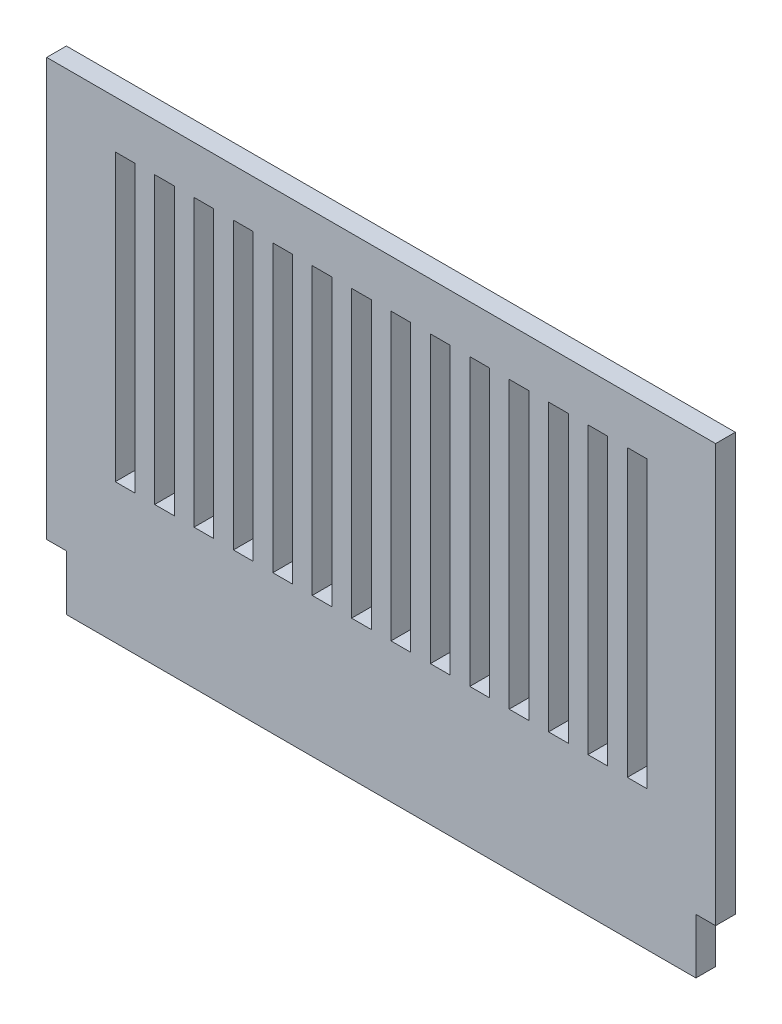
ISO-10303-21;
HEADER;
FILE_DESCRIPTION(('STEP AP214'),'2;1');
FILE_NAME('part.step','',(''),(''),'','','');
FILE_SCHEMA(('AUTOMOTIVE_DESIGN { 1 0 10303 214 1 1 1 1 }'));
ENDSEC;
DATA;
#1=APPLICATION_CONTEXT('core data for automotive mechanical design processes');
#2=APPLICATION_PROTOCOL_DEFINITION('international standard','automotive_design',2000,#1);
#3=PRODUCT_CONTEXT('',#1,'mechanical');
#4=PRODUCT('Part','Part','',(#3));
#5=PRODUCT_RELATED_PRODUCT_CATEGORY('part','',(#4));
#6=PRODUCT_DEFINITION_FORMATION('','',#4);
#7=PRODUCT_DEFINITION_CONTEXT('part definition',#1,'design');
#8=PRODUCT_DEFINITION('design','',#6,#7);
#9=PRODUCT_DEFINITION_SHAPE('','',#8);
#10=(LENGTH_UNIT() NAMED_UNIT(*) SI_UNIT(.MILLI.,.METRE.));
#11=(NAMED_UNIT(*) PLANE_ANGLE_UNIT() SI_UNIT($,.RADIAN.));
#12=(NAMED_UNIT(*) SI_UNIT($,.STERADIAN.) SOLID_ANGLE_UNIT());
#13=UNCERTAINTY_MEASURE_WITH_UNIT(LENGTH_MEASURE(1.E-05),#10,'distance_accuracy_value','');
#14=(GEOMETRIC_REPRESENTATION_CONTEXT(3) GLOBAL_UNCERTAINTY_ASSIGNED_CONTEXT((#13)) GLOBAL_UNIT_ASSIGNED_CONTEXT((#10,
#11,#12)) REPRESENTATION_CONTEXT('',''));
#15=CARTESIAN_POINT('',(0.,0.,0.));
#16=DIRECTION('',(0.,0.,1.));
#17=DIRECTION('',(1.,0.,0.));
#18=AXIS2_PLACEMENT_3D('',#15,#16,#17);
#19=CARTESIAN_POINT('',(-3.17499999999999,68.58,3.175));
#20=DIRECTION('',(0.,0.,-1.));
#21=DIRECTION('',(-1.,0.,0.));
#22=AXIS2_PLACEMENT_3D('',#19,#20,#21);
#23=PLANE('',#22);
#24=DIRECTION('',(0.,1.,0.));
#25=VECTOR('',#24,1.);
#26=CARTESIAN_POINT('',(42.8064587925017,14.8615323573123,3.175));
#27=LINE('',#26,#25);
#28=CARTESIAN_POINT('',(42.8064587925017,14.8615323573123,3.175));
#29=VERTEX_POINT('',#28);
#30=CARTESIAN_POINT('',(42.8064587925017,60.9116279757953,3.175));
#31=VERTEX_POINT('',#30);
#32=EDGE_CURVE('E470',#29,#31,#27,.T.);
#33=ORIENTED_EDGE('',*,*,#32,.F.);
#34=DIRECTION('',(1.,0.,0.));
#35=VECTOR('',#34,1.);
#36=CARTESIAN_POINT('',(42.8064587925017,14.8615323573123,3.175));
#37=LINE('',#36,#35);
#38=CARTESIAN_POINT('',(39.6314587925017,14.8615323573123,3.175));
#39=VERTEX_POINT('',#38);
#40=EDGE_CURVE('E478',#39,#29,#37,.T.);
#41=ORIENTED_EDGE('',*,*,#40,.F.);
#42=DIRECTION('',(0.,-1.,0.));
#43=VECTOR('',#42,1.);
#44=CARTESIAN_POINT('',(39.6314587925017,14.8615323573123,3.175));
#45=LINE('',#44,#43);
#46=CARTESIAN_POINT('',(39.6314587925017,60.9116279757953,3.175));
#47=VERTEX_POINT('',#46);
#48=EDGE_CURVE('E475',#47,#39,#45,.T.);
#49=ORIENTED_EDGE('',*,*,#48,.F.);
#50=DIRECTION('',(-1.,0.,0.));
#51=VECTOR('',#50,1.);
#52=CARTESIAN_POINT('',(42.8064587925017,60.9116279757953,3.175));
#53=LINE('',#52,#51);
#54=EDGE_CURVE('E472',#31,#47,#53,.T.);
#55=ORIENTED_EDGE('',*,*,#54,.F.);
#56=EDGE_LOOP('',(#33,#41,#49,#55));
#57=FACE_BOUND('',#56,.T.);
#58=DIRECTION('',(0.,1.,0.));
#59=VECTOR('',#58,1.);
#60=CARTESIAN_POINT('',(30.1064587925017,14.8615323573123,3.175));
#61=LINE('',#60,#59);
#62=CARTESIAN_POINT('',(30.1064587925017,14.8615323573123,3.175));
#63=VERTEX_POINT('',#62);
#64=CARTESIAN_POINT('',(30.1064587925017,60.9116279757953,3.175));
#65=VERTEX_POINT('',#64);
#66=EDGE_CURVE('E532',#63,#65,#61,.T.);
#67=ORIENTED_EDGE('',*,*,#66,.F.);
#68=DIRECTION('',(1.,0.,0.));
#69=VECTOR('',#68,1.);
#70=CARTESIAN_POINT('',(30.1064587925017,14.8615323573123,3.175));
#71=LINE('',#70,#69);
#72=CARTESIAN_POINT('',(26.9314587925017,14.8615323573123,3.175));
#73=VERTEX_POINT('',#72);
#74=EDGE_CURVE('E540',#73,#63,#71,.T.);
#75=ORIENTED_EDGE('',*,*,#74,.F.);
#76=DIRECTION('',(0.,-1.,0.));
#77=VECTOR('',#76,1.);
#78=CARTESIAN_POINT('',(26.9314587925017,14.8615323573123,3.175));
#79=LINE('',#78,#77);
#80=CARTESIAN_POINT('',(26.9314587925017,60.9116279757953,3.175));
#81=VERTEX_POINT('',#80);
#82=EDGE_CURVE('E537',#81,#73,#79,.T.);
#83=ORIENTED_EDGE('',*,*,#82,.F.);
#84=DIRECTION('',(-1.,0.,0.));
#85=VECTOR('',#84,1.);
#86=CARTESIAN_POINT('',(30.1064587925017,60.9116279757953,3.175));
#87=LINE('',#86,#85);
#88=EDGE_CURVE('E534',#65,#81,#87,.T.);
#89=ORIENTED_EDGE('',*,*,#88,.F.);
#90=EDGE_LOOP('',(#67,#75,#83,#89));
#91=FACE_BOUND('',#90,.T.);
#92=DIRECTION('',(0.,1.,0.));
#93=VECTOR('',#92,1.);
#94=CARTESIAN_POINT('',(17.4064587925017,14.8615323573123,3.175));
#95=LINE('',#94,#93);
#96=CARTESIAN_POINT('',(17.4064587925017,14.8615323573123,3.175));
#97=VERTEX_POINT('',#96);
#98=CARTESIAN_POINT('',(17.4064587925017,60.9116279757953,3.175));
#99=VERTEX_POINT('',#98);
#100=EDGE_CURVE('E594',#97,#99,#95,.T.);
#101=ORIENTED_EDGE('',*,*,#100,.F.);
#102=DIRECTION('',(1.,0.,0.));
#103=VECTOR('',#102,1.);
#104=CARTESIAN_POINT('',(17.4064587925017,14.8615323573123,3.175));
#105=LINE('',#104,#103);
#106=CARTESIAN_POINT('',(14.2314587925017,14.8615323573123,3.175));
#107=VERTEX_POINT('',#106);
#108=EDGE_CURVE('E602',#107,#97,#105,.T.);
#109=ORIENTED_EDGE('',*,*,#108,.F.);
#110=DIRECTION('',(0.,-1.,0.));
#111=VECTOR('',#110,1.);
#112=CARTESIAN_POINT('',(14.2314587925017,14.8615323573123,3.175));
#113=LINE('',#112,#111);
#114=CARTESIAN_POINT('',(14.2314587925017,60.9116279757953,3.175));
#115=VERTEX_POINT('',#114);
#116=EDGE_CURVE('E599',#115,#107,#113,.T.);
#117=ORIENTED_EDGE('',*,*,#116,.F.);
#118=DIRECTION('',(-1.,0.,0.));
#119=VECTOR('',#118,1.);
#120=CARTESIAN_POINT('',(17.4064587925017,60.9116279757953,3.175));
#121=LINE('',#120,#119);
#122=EDGE_CURVE('E596',#99,#115,#121,.T.);
#123=ORIENTED_EDGE('',*,*,#122,.F.);
#124=EDGE_LOOP('',(#101,#109,#117,#123));
#125=FACE_BOUND('',#124,.T.);
#126=DIRECTION('',(1.,0.,0.));
#127=VECTOR('',#126,1.);
#128=CARTESIAN_POINT('',(77.7314587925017,14.8615323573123,3.175));
#129=LINE('',#128,#127);
#130=CARTESIAN_POINT('',(77.7314587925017,14.8615323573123,3.175));
#131=VERTEX_POINT('',#130);
#132=CARTESIAN_POINT('',(80.9064587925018,14.8615323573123,3.175));
#133=VERTEX_POINT('',#132);
#134=EDGE_CURVE('E656',#131,#133,#129,.T.);
#135=ORIENTED_EDGE('',*,*,#134,.F.);
#136=DIRECTION('',(0.,-1.,0.));
#137=VECTOR('',#136,1.);
#138=CARTESIAN_POINT('',(77.7314587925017,14.8615323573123,3.175));
#139=LINE('',#138,#137);
#140=CARTESIAN_POINT('',(77.7314587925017,60.9116279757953,3.175));
#141=VERTEX_POINT('',#140);
#142=EDGE_CURVE('E664',#141,#131,#139,.T.);
#143=ORIENTED_EDGE('',*,*,#142,.F.);
#144=DIRECTION('',(-1.,0.,0.));
#145=VECTOR('',#144,1.);
#146=CARTESIAN_POINT('',(77.7314587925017,60.9116279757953,3.175));
#147=LINE('',#146,#145);
#148=CARTESIAN_POINT('',(80.9064587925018,60.9116279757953,3.175));
#149=VERTEX_POINT('',#148);
#150=EDGE_CURVE('E661',#149,#141,#147,.T.);
#151=ORIENTED_EDGE('',*,*,#150,.F.);
#152=DIRECTION('',(0.,1.,0.));
#153=VECTOR('',#152,1.);
#154=CARTESIAN_POINT('',(80.9064587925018,14.8615323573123,3.175));
#155=LINE('',#154,#153);
#156=EDGE_CURVE('E658',#133,#149,#155,.T.);
#157=ORIENTED_EDGE('',*,*,#156,.F.);
#158=EDGE_LOOP('',(#135,#143,#151,#157));
#159=FACE_BOUND('',#158,.T.);
#160=DIRECTION('',(1.,0.,0.));
#161=VECTOR('',#160,1.);
#162=CARTESIAN_POINT('',(65.0314587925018,14.8615323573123,3.175));
#163=LINE('',#162,#161);
#164=CARTESIAN_POINT('',(65.0314587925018,14.8615323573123,3.175));
#165=VERTEX_POINT('',#164);
#166=CARTESIAN_POINT('',(68.2064587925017,14.8615323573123,3.175));
#167=VERTEX_POINT('',#166);
#168=EDGE_CURVE('E718',#165,#167,#163,.T.);
#169=ORIENTED_EDGE('',*,*,#168,.F.);
#170=DIRECTION('',(0.,-1.,0.));
#171=VECTOR('',#170,1.);
#172=CARTESIAN_POINT('',(65.0314587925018,14.8615323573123,3.175));
#173=LINE('',#172,#171);
#174=CARTESIAN_POINT('',(65.0314587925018,60.9116279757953,3.175));
#175=VERTEX_POINT('',#174);
#176=EDGE_CURVE('E726',#175,#165,#173,.T.);
#177=ORIENTED_EDGE('',*,*,#176,.F.);
#178=DIRECTION('',(-1.,0.,0.));
#179=VECTOR('',#178,1.);
#180=CARTESIAN_POINT('',(65.0314587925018,60.9116279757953,3.175));
#181=LINE('',#180,#179);
#182=CARTESIAN_POINT('',(68.2064587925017,60.9116279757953,3.175));
#183=VERTEX_POINT('',#182);
#184=EDGE_CURVE('E723',#183,#175,#181,.T.);
#185=ORIENTED_EDGE('',*,*,#184,.F.);
#186=DIRECTION('',(0.,1.,0.));
#187=VECTOR('',#186,1.);
#188=CARTESIAN_POINT('',(68.2064587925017,14.8615323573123,3.175));
#189=LINE('',#188,#187);
#190=EDGE_CURVE('E720',#167,#183,#189,.T.);
#191=ORIENTED_EDGE('',*,*,#190,.F.);
#192=EDGE_LOOP('',(#169,#177,#185,#191));
#193=FACE_BOUND('',#192,.T.);
#194=DIRECTION('',(0.,1.,0.));
#195=VECTOR('',#194,1.);
#196=CARTESIAN_POINT('',(11.0564587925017,14.8615323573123,3.175));
#197=LINE('',#196,#195);
#198=CARTESIAN_POINT('',(11.0564587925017,14.8615323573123,3.175));
#199=VERTEX_POINT('',#198);
#200=CARTESIAN_POINT('',(11.0564587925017,60.9116279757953,3.175));
#201=VERTEX_POINT('',#200);
#202=EDGE_CURVE('E780',#199,#201,#197,.T.);
#203=ORIENTED_EDGE('',*,*,#202,.F.);
#204=DIRECTION('',(1.,0.,0.));
#205=VECTOR('',#204,1.);
#206=CARTESIAN_POINT('',(11.0564587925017,14.8615323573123,3.175));
#207=LINE('',#206,#205);
#208=CARTESIAN_POINT('',(7.88145879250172,14.8615323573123,3.175));
#209=VERTEX_POINT('',#208);
#210=EDGE_CURVE('E788',#209,#199,#207,.T.);
#211=ORIENTED_EDGE('',*,*,#210,.F.);
#212=DIRECTION('',(0.,-1.,0.));
#213=VECTOR('',#212,1.);
#214=CARTESIAN_POINT('',(7.88145879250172,14.8615323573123,3.175));
#215=LINE('',#214,#213);
#216=CARTESIAN_POINT('',(7.88145879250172,60.9116279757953,3.175));
#217=VERTEX_POINT('',#216);
#218=EDGE_CURVE('E785',#217,#209,#215,.T.);
#219=ORIENTED_EDGE('',*,*,#218,.F.);
#220=DIRECTION('',(-1.,0.,0.));
#221=VECTOR('',#220,1.);
#222=CARTESIAN_POINT('',(11.0564587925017,60.9116279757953,3.175));
#223=LINE('',#222,#221);
#224=EDGE_CURVE('E782',#201,#217,#223,.T.);
#225=ORIENTED_EDGE('',*,*,#224,.F.);
#226=EDGE_LOOP('',(#203,#211,#219,#225));
#227=FACE_BOUND('',#226,.T.);
#228=DIRECTION('',(1.,0.,0.));
#229=VECTOR('',#228,1.);
#230=CARTESIAN_POINT('',(52.3314587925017,14.8615323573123,3.175));
#231=LINE('',#230,#229);
#232=CARTESIAN_POINT('',(52.3314587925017,14.8615323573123,3.175));
#233=VERTEX_POINT('',#232);
#234=CARTESIAN_POINT('',(55.5064587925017,14.8615323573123,3.175));
#235=VERTEX_POINT('',#234);
#236=EDGE_CURVE('E842',#233,#235,#231,.T.);
#237=ORIENTED_EDGE('',*,*,#236,.F.);
#238=DIRECTION('',(0.,-1.,0.));
#239=VECTOR('',#238,1.);
#240=CARTESIAN_POINT('',(52.3314587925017,14.8615323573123,3.175));
#241=LINE('',#240,#239);
#242=CARTESIAN_POINT('',(52.3314587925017,60.9116279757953,3.175));
#243=VERTEX_POINT('',#242);
#244=EDGE_CURVE('E850',#243,#233,#241,.T.);
#245=ORIENTED_EDGE('',*,*,#244,.F.);
#246=DIRECTION('',(-1.,0.,0.));
#247=VECTOR('',#246,1.);
#248=CARTESIAN_POINT('',(52.3314587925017,60.9116279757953,3.175));
#249=LINE('',#248,#247);
#250=CARTESIAN_POINT('',(55.5064587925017,60.9116279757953,3.175));
#251=VERTEX_POINT('',#250);
#252=EDGE_CURVE('E847',#251,#243,#249,.T.);
#253=ORIENTED_EDGE('',*,*,#252,.F.);
#254=DIRECTION('',(0.,1.,0.));
#255=VECTOR('',#254,1.);
#256=CARTESIAN_POINT('',(55.5064587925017,14.8615323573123,3.175));
#257=LINE('',#256,#255);
#258=EDGE_CURVE('E844',#235,#251,#257,.T.);
#259=ORIENTED_EDGE('',*,*,#258,.F.);
#260=EDGE_LOOP('',(#237,#245,#253,#259));
#261=FACE_BOUND('',#260,.T.);
#262=DIRECTION('',(0.,-1.,0.));
#263=VECTOR('',#262,1.);
#264=CARTESIAN_POINT('',(-3.17499999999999,1.27000000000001,3.175));
#265=LINE('',#264,#263);
#266=CARTESIAN_POINT('',(-3.17499999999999,68.58,3.175));
#267=VERTEX_POINT('',#266);
#268=CARTESIAN_POINT('',(-3.17499999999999,1.27000000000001,3.175));
#269=VERTEX_POINT('',#268);
#270=EDGE_CURVE('E873',#267,#269,#265,.T.);
#271=ORIENTED_EDGE('',*,*,#270,.T.);
#272=DIRECTION('',(1.,0.,0.));
#273=VECTOR('',#272,1.);
#274=CARTESIAN_POINT('',(0.,1.27000000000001,3.175));
#275=LINE('',#274,#273);
#276=CARTESIAN_POINT('',(0.,1.27000000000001,3.175));
#277=VERTEX_POINT('',#276);
#278=EDGE_CURVE('E876',#269,#277,#275,.T.);
#279=ORIENTED_EDGE('',*,*,#278,.T.);
#280=DIRECTION('',(0.,-1.,0.));
#281=VECTOR('',#280,1.);
#282=CARTESIAN_POINT('',(0.,-7.61999999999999,3.175));
#283=LINE('',#282,#281);
#284=CARTESIAN_POINT('',(0.,-7.61999999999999,3.175));
#285=VERTEX_POINT('',#284);
#286=EDGE_CURVE('E879',#277,#285,#283,.T.);
#287=ORIENTED_EDGE('',*,*,#286,.T.);
#288=DIRECTION('',(1.,0.,0.));
#289=VECTOR('',#288,1.);
#290=CARTESIAN_POINT('',(101.487917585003,-7.61999999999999,3.175));
#291=LINE('',#290,#289);
#292=CARTESIAN_POINT('',(101.487917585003,-7.61999999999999,3.175));
#293=VERTEX_POINT('',#292);
#294=EDGE_CURVE('E881',#285,#293,#291,.T.);
#295=ORIENTED_EDGE('',*,*,#294,.T.);
#296=DIRECTION('',(0.,1.,0.));
#297=VECTOR('',#296,1.);
#298=CARTESIAN_POINT('',(101.487917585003,1.27000000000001,3.175));
#299=LINE('',#298,#297);
#300=CARTESIAN_POINT('',(101.487917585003,1.27000000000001,3.175));
#301=VERTEX_POINT('',#300);
#302=EDGE_CURVE('E883',#293,#301,#299,.T.);
#303=ORIENTED_EDGE('',*,*,#302,.T.);
#304=DIRECTION('',(1.,0.,0.));
#305=VECTOR('',#304,1.);
#306=CARTESIAN_POINT('',(104.662917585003,1.27000000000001,3.175));
#307=LINE('',#306,#305);
#308=CARTESIAN_POINT('',(104.662917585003,1.27000000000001,3.175));
#309=VERTEX_POINT('',#308);
#310=EDGE_CURVE('E885',#301,#309,#307,.T.);
#311=ORIENTED_EDGE('',*,*,#310,.T.);
#312=DIRECTION('',(0.,1.,0.));
#313=VECTOR('',#312,1.);
#314=CARTESIAN_POINT('',(104.662917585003,68.58,3.175));
#315=LINE('',#314,#313);
#316=CARTESIAN_POINT('',(104.662917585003,68.58,3.175));
#317=VERTEX_POINT('',#316);
#318=EDGE_CURVE('E887',#309,#317,#315,.T.);
#319=ORIENTED_EDGE('',*,*,#318,.T.);
#320=DIRECTION('',(-1.,0.,0.));
#321=VECTOR('',#320,1.);
#322=CARTESIAN_POINT('',(-3.17499999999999,68.58,3.175));
#323=LINE('',#322,#321);
#324=EDGE_CURVE('E889',#317,#267,#323,.T.);
#325=ORIENTED_EDGE('',*,*,#324,.T.);
#326=EDGE_LOOP('',(#271,#279,#287,#295,#303,#311,#319,#325));
#327=FACE_BOUND('',#326,.T.);
#328=DIRECTION('',(1.,0.,0.));
#329=VECTOR('',#328,1.);
#330=CARTESIAN_POINT('',(90.4314587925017,14.8615323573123,3.175));
#331=LINE('',#330,#329);
#332=CARTESIAN_POINT('',(90.4314587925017,14.8615323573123,3.175));
#333=VERTEX_POINT('',#332);
#334=CARTESIAN_POINT('',(93.6064587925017,14.8615323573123,3.175));
#335=VERTEX_POINT('',#334);
#336=EDGE_CURVE('E811',#333,#335,#331,.T.);
#337=ORIENTED_EDGE('',*,*,#336,.F.);
#338=DIRECTION('',(0.,-1.,0.));
#339=VECTOR('',#338,1.);
#340=CARTESIAN_POINT('',(90.4314587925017,14.8615323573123,3.175));
#341=LINE('',#340,#339);
#342=CARTESIAN_POINT('',(90.4314587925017,60.9116279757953,3.175));
#343=VERTEX_POINT('',#342);
#344=EDGE_CURVE('E819',#343,#333,#341,.T.);
#345=ORIENTED_EDGE('',*,*,#344,.F.);
#346=DIRECTION('',(-1.,0.,0.));
#347=VECTOR('',#346,1.);
#348=CARTESIAN_POINT('',(90.4314587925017,60.9116279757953,3.175));
#349=LINE('',#348,#347);
#350=CARTESIAN_POINT('',(93.6064587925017,60.9116279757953,3.175));
#351=VERTEX_POINT('',#350);
#352=EDGE_CURVE('E816',#351,#343,#349,.T.);
#353=ORIENTED_EDGE('',*,*,#352,.F.);
#354=DIRECTION('',(0.,1.,0.));
#355=VECTOR('',#354,1.);
#356=CARTESIAN_POINT('',(93.6064587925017,14.8615323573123,3.175));
#357=LINE('',#356,#355);
#358=EDGE_CURVE('E813',#335,#351,#357,.T.);
#359=ORIENTED_EDGE('',*,*,#358,.F.);
#360=EDGE_LOOP('',(#337,#345,#353,#359));
#361=FACE_BOUND('',#360,.T.);
#362=DIRECTION('',(1.,0.,0.));
#363=VECTOR('',#362,1.);
#364=CARTESIAN_POINT('',(58.6814587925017,14.8615323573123,3.175));
#365=LINE('',#364,#363);
#366=CARTESIAN_POINT('',(58.6814587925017,14.8615323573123,3.175));
#367=VERTEX_POINT('',#366);
#368=CARTESIAN_POINT('',(61.8564587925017,14.8615323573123,3.175));
#369=VERTEX_POINT('',#368);
#370=EDGE_CURVE('E749',#367,#369,#365,.T.);
#371=ORIENTED_EDGE('',*,*,#370,.F.);
#372=DIRECTION('',(0.,-1.,0.));
#373=VECTOR('',#372,1.);
#374=CARTESIAN_POINT('',(58.6814587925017,14.8615323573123,3.175));
#375=LINE('',#374,#373);
#376=CARTESIAN_POINT('',(58.6814587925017,60.9116279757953,3.175));
#377=VERTEX_POINT('',#376);
#378=EDGE_CURVE('E757',#377,#367,#375,.T.);
#379=ORIENTED_EDGE('',*,*,#378,.F.);
#380=DIRECTION('',(-1.,0.,0.));
#381=VECTOR('',#380,1.);
#382=CARTESIAN_POINT('',(58.6814587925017,60.9116279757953,3.175));
#383=LINE('',#382,#381);
#384=CARTESIAN_POINT('',(61.8564587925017,60.9116279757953,3.175));
#385=VERTEX_POINT('',#384);
#386=EDGE_CURVE('E754',#385,#377,#383,.T.);
#387=ORIENTED_EDGE('',*,*,#386,.F.);
#388=DIRECTION('',(0.,1.,0.));
#389=VECTOR('',#388,1.);
#390=CARTESIAN_POINT('',(61.8564587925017,14.8615323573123,3.175));
#391=LINE('',#390,#389);
#392=EDGE_CURVE('E751',#369,#385,#391,.T.);
#393=ORIENTED_EDGE('',*,*,#392,.F.);
#394=EDGE_LOOP('',(#371,#379,#387,#393));
#395=FACE_BOUND('',#394,.T.);
#396=DIRECTION('',(1.,0.,0.));
#397=VECTOR('',#396,1.);
#398=CARTESIAN_POINT('',(71.3814587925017,14.8615323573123,3.175));
#399=LINE('',#398,#397);
#400=CARTESIAN_POINT('',(71.3814587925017,14.8615323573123,3.175));
#401=VERTEX_POINT('',#400);
#402=CARTESIAN_POINT('',(74.5564587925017,14.8615323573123,3.175));
#403=VERTEX_POINT('',#402);
#404=EDGE_CURVE('E687',#401,#403,#399,.T.);
#405=ORIENTED_EDGE('',*,*,#404,.F.);
#406=DIRECTION('',(0.,-1.,0.));
#407=VECTOR('',#406,1.);
#408=CARTESIAN_POINT('',(71.3814587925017,14.8615323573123,3.175));
#409=LINE('',#408,#407);
#410=CARTESIAN_POINT('',(71.3814587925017,60.9116279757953,3.175));
#411=VERTEX_POINT('',#410);
#412=EDGE_CURVE('E695',#411,#401,#409,.T.);
#413=ORIENTED_EDGE('',*,*,#412,.F.);
#414=DIRECTION('',(-1.,0.,0.));
#415=VECTOR('',#414,1.);
#416=CARTESIAN_POINT('',(71.3814587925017,60.9116279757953,3.175));
#417=LINE('',#416,#415);
#418=CARTESIAN_POINT('',(74.5564587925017,60.9116279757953,3.175));
#419=VERTEX_POINT('',#418);
#420=EDGE_CURVE('E692',#419,#411,#417,.T.);
#421=ORIENTED_EDGE('',*,*,#420,.F.);
#422=DIRECTION('',(0.,1.,0.));
#423=VECTOR('',#422,1.);
#424=CARTESIAN_POINT('',(74.5564587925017,14.8615323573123,3.175));
#425=LINE('',#424,#423);
#426=EDGE_CURVE('E689',#403,#419,#425,.T.);
#427=ORIENTED_EDGE('',*,*,#426,.F.);
#428=EDGE_LOOP('',(#405,#413,#421,#427));
#429=FACE_BOUND('',#428,.T.);
#430=DIRECTION('',(1.,0.,0.));
#431=VECTOR('',#430,1.);
#432=CARTESIAN_POINT('',(84.0814587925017,14.8615323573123,3.175));
#433=LINE('',#432,#431);
#434=CARTESIAN_POINT('',(84.0814587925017,14.8615323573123,3.175));
#435=VERTEX_POINT('',#434);
#436=CARTESIAN_POINT('',(87.2564587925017,14.8615323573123,3.175));
#437=VERTEX_POINT('',#436);
#438=EDGE_CURVE('E625',#435,#437,#433,.T.);
#439=ORIENTED_EDGE('',*,*,#438,.F.);
#440=DIRECTION('',(0.,-1.,0.));
#441=VECTOR('',#440,1.);
#442=CARTESIAN_POINT('',(84.0814587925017,14.8615323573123,3.175));
#443=LINE('',#442,#441);
#444=CARTESIAN_POINT('',(84.0814587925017,60.9116279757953,3.175));
#445=VERTEX_POINT('',#444);
#446=EDGE_CURVE('E633',#445,#435,#443,.T.);
#447=ORIENTED_EDGE('',*,*,#446,.F.);
#448=DIRECTION('',(-1.,0.,0.));
#449=VECTOR('',#448,1.);
#450=CARTESIAN_POINT('',(84.0814587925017,60.9116279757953,3.175));
#451=LINE('',#450,#449);
#452=CARTESIAN_POINT('',(87.2564587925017,60.9116279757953,3.175));
#453=VERTEX_POINT('',#452);
#454=EDGE_CURVE('E630',#453,#445,#451,.T.);
#455=ORIENTED_EDGE('',*,*,#454,.F.);
#456=DIRECTION('',(0.,1.,0.));
#457=VECTOR('',#456,1.);
#458=CARTESIAN_POINT('',(87.2564587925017,14.8615323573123,3.175));
#459=LINE('',#458,#457);
#460=EDGE_CURVE('E627',#437,#453,#459,.T.);
#461=ORIENTED_EDGE('',*,*,#460,.F.);
#462=EDGE_LOOP('',(#439,#447,#455,#461));
#463=FACE_BOUND('',#462,.T.);
#464=DIRECTION('',(0.,1.,0.));
#465=VECTOR('',#464,1.);
#466=CARTESIAN_POINT('',(23.7564587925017,14.8615323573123,3.175));
#467=LINE('',#466,#465);
#468=CARTESIAN_POINT('',(23.7564587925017,14.8615323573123,3.175));
#469=VERTEX_POINT('',#468);
#470=CARTESIAN_POINT('',(23.7564587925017,60.9116279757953,3.175));
#471=VERTEX_POINT('',#470);
#472=EDGE_CURVE('E563',#469,#471,#467,.T.);
#473=ORIENTED_EDGE('',*,*,#472,.F.);
#474=DIRECTION('',(1.,0.,0.));
#475=VECTOR('',#474,1.);
#476=CARTESIAN_POINT('',(23.7564587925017,14.8615323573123,3.175));
#477=LINE('',#476,#475);
#478=CARTESIAN_POINT('',(20.5814587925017,14.8615323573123,3.175));
#479=VERTEX_POINT('',#478);
#480=EDGE_CURVE('E571',#479,#469,#477,.T.);
#481=ORIENTED_EDGE('',*,*,#480,.F.);
#482=DIRECTION('',(0.,-1.,0.));
#483=VECTOR('',#482,1.);
#484=CARTESIAN_POINT('',(20.5814587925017,14.8615323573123,3.175));
#485=LINE('',#484,#483);
#486=CARTESIAN_POINT('',(20.5814587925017,60.9116279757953,3.175));
#487=VERTEX_POINT('',#486);
#488=EDGE_CURVE('E568',#487,#479,#485,.T.);
#489=ORIENTED_EDGE('',*,*,#488,.F.);
#490=DIRECTION('',(-1.,0.,0.));
#491=VECTOR('',#490,1.);
#492=CARTESIAN_POINT('',(23.7564587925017,60.9116279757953,3.175));
#493=LINE('',#492,#491);
#494=EDGE_CURVE('E565',#471,#487,#493,.T.);
#495=ORIENTED_EDGE('',*,*,#494,.F.);
#496=EDGE_LOOP('',(#473,#481,#489,#495));
#497=FACE_BOUND('',#496,.T.);
#498=DIRECTION('',(0.,1.,0.));
#499=VECTOR('',#498,1.);
#500=CARTESIAN_POINT('',(36.4564587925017,14.8615323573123,3.175));
#501=LINE('',#500,#499);
#502=CARTESIAN_POINT('',(36.4564587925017,14.8615323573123,3.175));
#503=VERTEX_POINT('',#502);
#504=CARTESIAN_POINT('',(36.4564587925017,60.9116279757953,3.175));
#505=VERTEX_POINT('',#504);
#506=EDGE_CURVE('E501',#503,#505,#501,.T.);
#507=ORIENTED_EDGE('',*,*,#506,.F.);
#508=DIRECTION('',(1.,0.,0.));
#509=VECTOR('',#508,1.);
#510=CARTESIAN_POINT('',(36.4564587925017,14.8615323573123,3.175));
#511=LINE('',#510,#509);
#512=CARTESIAN_POINT('',(33.2814587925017,14.8615323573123,3.175));
#513=VERTEX_POINT('',#512);
#514=EDGE_CURVE('E509',#513,#503,#511,.T.);
#515=ORIENTED_EDGE('',*,*,#514,.F.);
#516=DIRECTION('',(0.,-1.,0.));
#517=VECTOR('',#516,1.);
#518=CARTESIAN_POINT('',(33.2814587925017,14.8615323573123,3.175));
#519=LINE('',#518,#517);
#520=CARTESIAN_POINT('',(33.2814587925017,60.9116279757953,3.175));
#521=VERTEX_POINT('',#520);
#522=EDGE_CURVE('E506',#521,#513,#519,.T.);
#523=ORIENTED_EDGE('',*,*,#522,.F.);
#524=DIRECTION('',(-1.,0.,0.));
#525=VECTOR('',#524,1.);
#526=CARTESIAN_POINT('',(36.4564587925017,60.9116279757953,3.175));
#527=LINE('',#526,#525);
#528=EDGE_CURVE('E503',#505,#521,#527,.T.);
#529=ORIENTED_EDGE('',*,*,#528,.F.);
#530=EDGE_LOOP('',(#507,#515,#523,#529));
#531=FACE_BOUND('',#530,.T.);
#532=DIRECTION('',(0.,1.,0.));
#533=VECTOR('',#532,1.);
#534=CARTESIAN_POINT('',(49.1564587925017,14.8615323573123,3.175));
#535=LINE('',#534,#533);
#536=CARTESIAN_POINT('',(49.1564587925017,14.8615323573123,3.175));
#537=VERTEX_POINT('',#536);
#538=CARTESIAN_POINT('',(49.1564587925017,60.9116279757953,3.175));
#539=VERTEX_POINT('',#538);
#540=EDGE_CURVE('E434',#537,#539,#535,.T.);
#541=ORIENTED_EDGE('',*,*,#540,.F.);
#542=DIRECTION('',(1.,0.,0.));
#543=VECTOR('',#542,1.);
#544=CARTESIAN_POINT('',(49.1564587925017,14.8615323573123,3.175));
#545=LINE('',#544,#543);
#546=CARTESIAN_POINT('',(45.9814587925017,14.8615323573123,3.175));
#547=VERTEX_POINT('',#546);
#548=EDGE_CURVE('E456',#547,#537,#545,.T.);
#549=ORIENTED_EDGE('',*,*,#548,.F.);
#550=DIRECTION('',(0.,-1.,0.));
#551=VECTOR('',#550,1.);
#552=CARTESIAN_POINT('',(45.9814587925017,14.8615323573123,3.175));
#553=LINE('',#552,#551);
#554=CARTESIAN_POINT('',(45.9814587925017,60.9116279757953,3.175));
#555=VERTEX_POINT('',#554);
#556=EDGE_CURVE('E454',#555,#547,#553,.T.);
#557=ORIENTED_EDGE('',*,*,#556,.F.);
#558=DIRECTION('',(-1.,0.,0.));
#559=VECTOR('',#558,1.);
#560=CARTESIAN_POINT('',(49.1564587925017,60.9116279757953,3.175));
#561=LINE('',#560,#559);
#562=EDGE_CURVE('E442',#539,#555,#561,.T.);
#563=ORIENTED_EDGE('',*,*,#562,.F.);
#564=EDGE_LOOP('',(#541,#549,#557,#563));
#565=FACE_BOUND('',#564,.T.);
#566=ADVANCED_FACE('F33',(#57,#91,#125,#159,#193,#227,#261,#327,#361,#395,#429,#463,#497,#531,
#565),#23,.F.);
#567=CARTESIAN_POINT('',(-3.17499999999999,68.58,0.));
#568=DIRECTION('',(0.,0.,-1.));
#569=DIRECTION('',(-1.,0.,0.));
#570=AXIS2_PLACEMENT_3D('',#567,#568,#569);
#571=PLANE('',#570);
#572=DIRECTION('',(1.,0.,0.));
#573=VECTOR('',#572,1.);
#574=CARTESIAN_POINT('',(42.8064587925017,14.8615323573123,0.));
#575=LINE('',#574,#573);
#576=CARTESIAN_POINT('',(39.6314587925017,14.8615323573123,0.));
#577=VERTEX_POINT('',#576);
#578=CARTESIAN_POINT('',(42.8064587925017,14.8615323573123,0.));
#579=VERTEX_POINT('',#578);
#580=EDGE_CURVE('E473',#577,#579,#575,.T.);
#581=ORIENTED_EDGE('',*,*,#580,.T.);
#582=DIRECTION('',(0.,1.,0.));
#583=VECTOR('',#582,1.);
#584=CARTESIAN_POINT('',(42.8064587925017,14.8615323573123,0.));
#585=LINE('',#584,#583);
#586=CARTESIAN_POINT('',(42.8064587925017,60.9116279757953,0.));
#587=VERTEX_POINT('',#586);
#588=EDGE_CURVE('E450',#579,#587,#585,.T.);
#589=ORIENTED_EDGE('',*,*,#588,.T.);
#590=DIRECTION('',(-1.,0.,0.));
#591=VECTOR('',#590,1.);
#592=CARTESIAN_POINT('',(42.8064587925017,60.9116279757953,0.));
#593=LINE('',#592,#591);
#594=CARTESIAN_POINT('',(39.6314587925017,60.9116279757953,0.));
#595=VERTEX_POINT('',#594);
#596=EDGE_CURVE('E483',#587,#595,#593,.T.);
#597=ORIENTED_EDGE('',*,*,#596,.T.);
#598=DIRECTION('',(0.,-1.,0.));
#599=VECTOR('',#598,1.);
#600=CARTESIAN_POINT('',(39.6314587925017,14.8615323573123,0.));
#601=LINE('',#600,#599);
#602=EDGE_CURVE('E486',#595,#577,#601,.T.);
#603=ORIENTED_EDGE('',*,*,#602,.T.);
#604=EDGE_LOOP('',(#581,#589,#597,#603));
#605=FACE_BOUND('',#604,.T.);
#606=DIRECTION('',(1.,0.,0.));
#607=VECTOR('',#606,1.);
#608=CARTESIAN_POINT('',(30.1064587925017,14.8615323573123,0.));
#609=LINE('',#608,#607);
#610=CARTESIAN_POINT('',(26.9314587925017,14.8615323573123,0.));
#611=VERTEX_POINT('',#610);
#612=CARTESIAN_POINT('',(30.1064587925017,14.8615323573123,0.));
#613=VERTEX_POINT('',#612);
#614=EDGE_CURVE('E535',#611,#613,#609,.T.);
#615=ORIENTED_EDGE('',*,*,#614,.T.);
#616=DIRECTION('',(0.,1.,0.));
#617=VECTOR('',#616,1.);
#618=CARTESIAN_POINT('',(30.1064587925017,14.8615323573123,0.));
#619=LINE('',#618,#617);
#620=CARTESIAN_POINT('',(30.1064587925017,60.9116279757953,0.));
#621=VERTEX_POINT('',#620);
#622=EDGE_CURVE('E531',#613,#621,#619,.T.);
#623=ORIENTED_EDGE('',*,*,#622,.T.);
#624=DIRECTION('',(-1.,0.,0.));
#625=VECTOR('',#624,1.);
#626=CARTESIAN_POINT('',(30.1064587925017,60.9116279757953,0.));
#627=LINE('',#626,#625);
#628=CARTESIAN_POINT('',(26.9314587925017,60.9116279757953,0.));
#629=VERTEX_POINT('',#628);
#630=EDGE_CURVE('E545',#621,#629,#627,.T.);
#631=ORIENTED_EDGE('',*,*,#630,.T.);
#632=DIRECTION('',(0.,-1.,0.));
#633=VECTOR('',#632,1.);
#634=CARTESIAN_POINT('',(26.9314587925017,14.8615323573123,0.));
#635=LINE('',#634,#633);
#636=EDGE_CURVE('E548',#629,#611,#635,.T.);
#637=ORIENTED_EDGE('',*,*,#636,.T.);
#638=EDGE_LOOP('',(#615,#623,#631,#637));
#639=FACE_BOUND('',#638,.T.);
#640=DIRECTION('',(1.,0.,0.));
#641=VECTOR('',#640,1.);
#642=CARTESIAN_POINT('',(17.4064587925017,14.8615323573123,0.));
#643=LINE('',#642,#641);
#644=CARTESIAN_POINT('',(14.2314587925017,14.8615323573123,0.));
#645=VERTEX_POINT('',#644);
#646=CARTESIAN_POINT('',(17.4064587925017,14.8615323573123,0.));
#647=VERTEX_POINT('',#646);
#648=EDGE_CURVE('E597',#645,#647,#643,.T.);
#649=ORIENTED_EDGE('',*,*,#648,.T.);
#650=DIRECTION('',(0.,1.,0.));
#651=VECTOR('',#650,1.);
#652=CARTESIAN_POINT('',(17.4064587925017,14.8615323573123,0.));
#653=LINE('',#652,#651);
#654=CARTESIAN_POINT('',(17.4064587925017,60.9116279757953,0.));
#655=VERTEX_POINT('',#654);
#656=EDGE_CURVE('E593',#647,#655,#653,.T.);
#657=ORIENTED_EDGE('',*,*,#656,.T.);
#658=DIRECTION('',(-1.,0.,0.));
#659=VECTOR('',#658,1.);
#660=CARTESIAN_POINT('',(17.4064587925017,60.9116279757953,0.));
#661=LINE('',#660,#659);
#662=CARTESIAN_POINT('',(14.2314587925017,60.9116279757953,0.));
#663=VERTEX_POINT('',#662);
#664=EDGE_CURVE('E607',#655,#663,#661,.T.);
#665=ORIENTED_EDGE('',*,*,#664,.T.);
#666=DIRECTION('',(0.,-1.,0.));
#667=VECTOR('',#666,1.);
#668=CARTESIAN_POINT('',(14.2314587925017,14.8615323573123,0.));
#669=LINE('',#668,#667);
#670=EDGE_CURVE('E610',#663,#645,#669,.T.);
#671=ORIENTED_EDGE('',*,*,#670,.T.);
#672=EDGE_LOOP('',(#649,#657,#665,#671));
#673=FACE_BOUND('',#672,.T.);
#674=DIRECTION('',(0.,-1.,0.));
#675=VECTOR('',#674,1.);
#676=CARTESIAN_POINT('',(77.7314587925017,14.8615323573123,0.));
#677=LINE('',#676,#675);
#678=CARTESIAN_POINT('',(77.7314587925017,60.9116279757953,0.));
#679=VERTEX_POINT('',#678);
#680=CARTESIAN_POINT('',(77.7314587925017,14.8615323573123,0.));
#681=VERTEX_POINT('',#680);
#682=EDGE_CURVE('E659',#679,#681,#677,.T.);
#683=ORIENTED_EDGE('',*,*,#682,.T.);
#684=DIRECTION('',(1.,0.,0.));
#685=VECTOR('',#684,1.);
#686=CARTESIAN_POINT('',(77.7314587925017,14.8615323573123,0.));
#687=LINE('',#686,#685);
#688=CARTESIAN_POINT('',(80.9064587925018,14.8615323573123,0.));
#689=VERTEX_POINT('',#688);
#690=EDGE_CURVE('E655',#681,#689,#687,.T.);
#691=ORIENTED_EDGE('',*,*,#690,.T.);
#692=DIRECTION('',(0.,1.,0.));
#693=VECTOR('',#692,1.);
#694=CARTESIAN_POINT('',(80.9064587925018,14.8615323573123,0.));
#695=LINE('',#694,#693);
#696=CARTESIAN_POINT('',(80.9064587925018,60.9116279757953,0.));
#697=VERTEX_POINT('',#696);
#698=EDGE_CURVE('E669',#689,#697,#695,.T.);
#699=ORIENTED_EDGE('',*,*,#698,.T.);
#700=DIRECTION('',(-1.,0.,0.));
#701=VECTOR('',#700,1.);
#702=CARTESIAN_POINT('',(77.7314587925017,60.9116279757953,0.));
#703=LINE('',#702,#701);
#704=EDGE_CURVE('E672',#697,#679,#703,.T.);
#705=ORIENTED_EDGE('',*,*,#704,.T.);
#706=EDGE_LOOP('',(#683,#691,#699,#705));
#707=FACE_BOUND('',#706,.T.);
#708=DIRECTION('',(0.,-1.,0.));
#709=VECTOR('',#708,1.);
#710=CARTESIAN_POINT('',(65.0314587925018,14.8615323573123,0.));
#711=LINE('',#710,#709);
#712=CARTESIAN_POINT('',(65.0314587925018,60.9116279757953,0.));
#713=VERTEX_POINT('',#712);
#714=CARTESIAN_POINT('',(65.0314587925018,14.8615323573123,0.));
#715=VERTEX_POINT('',#714);
#716=EDGE_CURVE('E721',#713,#715,#711,.T.);
#717=ORIENTED_EDGE('',*,*,#716,.T.);
#718=DIRECTION('',(1.,0.,0.));
#719=VECTOR('',#718,1.);
#720=CARTESIAN_POINT('',(65.0314587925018,14.8615323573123,0.));
#721=LINE('',#720,#719);
#722=CARTESIAN_POINT('',(68.2064587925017,14.8615323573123,0.));
#723=VERTEX_POINT('',#722);
#724=EDGE_CURVE('E717',#715,#723,#721,.T.);
#725=ORIENTED_EDGE('',*,*,#724,.T.);
#726=DIRECTION('',(0.,1.,0.));
#727=VECTOR('',#726,1.);
#728=CARTESIAN_POINT('',(68.2064587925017,14.8615323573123,0.));
#729=LINE('',#728,#727);
#730=CARTESIAN_POINT('',(68.2064587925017,60.9116279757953,0.));
#731=VERTEX_POINT('',#730);
#732=EDGE_CURVE('E731',#723,#731,#729,.T.);
#733=ORIENTED_EDGE('',*,*,#732,.T.);
#734=DIRECTION('',(-1.,0.,0.));
#735=VECTOR('',#734,1.);
#736=CARTESIAN_POINT('',(65.0314587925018,60.9116279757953,0.));
#737=LINE('',#736,#735);
#738=EDGE_CURVE('E734',#731,#713,#737,.T.);
#739=ORIENTED_EDGE('',*,*,#738,.T.);
#740=EDGE_LOOP('',(#717,#725,#733,#739));
#741=FACE_BOUND('',#740,.T.);
#742=DIRECTION('',(1.,0.,0.));
#743=VECTOR('',#742,1.);
#744=CARTESIAN_POINT('',(11.0564587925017,14.8615323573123,0.));
#745=LINE('',#744,#743);
#746=CARTESIAN_POINT('',(7.88145879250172,14.8615323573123,0.));
#747=VERTEX_POINT('',#746);
#748=CARTESIAN_POINT('',(11.0564587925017,14.8615323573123,0.));
#749=VERTEX_POINT('',#748);
#750=EDGE_CURVE('E783',#747,#749,#745,.T.);
#751=ORIENTED_EDGE('',*,*,#750,.T.);
#752=DIRECTION('',(0.,1.,0.));
#753=VECTOR('',#752,1.);
#754=CARTESIAN_POINT('',(11.0564587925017,14.8615323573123,0.));
#755=LINE('',#754,#753);
#756=CARTESIAN_POINT('',(11.0564587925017,60.9116279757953,0.));
#757=VERTEX_POINT('',#756);
#758=EDGE_CURVE('E779',#749,#757,#755,.T.);
#759=ORIENTED_EDGE('',*,*,#758,.T.);
#760=DIRECTION('',(-1.,0.,0.));
#761=VECTOR('',#760,1.);
#762=CARTESIAN_POINT('',(11.0564587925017,60.9116279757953,0.));
#763=LINE('',#762,#761);
#764=CARTESIAN_POINT('',(7.88145879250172,60.9116279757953,0.));
#765=VERTEX_POINT('',#764);
#766=EDGE_CURVE('E793',#757,#765,#763,.T.);
#767=ORIENTED_EDGE('',*,*,#766,.T.);
#768=DIRECTION('',(0.,-1.,0.));
#769=VECTOR('',#768,1.);
#770=CARTESIAN_POINT('',(7.88145879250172,14.8615323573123,0.));
#771=LINE('',#770,#769);
#772=EDGE_CURVE('E796',#765,#747,#771,.T.);
#773=ORIENTED_EDGE('',*,*,#772,.T.);
#774=EDGE_LOOP('',(#751,#759,#767,#773));
#775=FACE_BOUND('',#774,.T.);
#776=DIRECTION('',(0.,-1.,0.));
#777=VECTOR('',#776,1.);
#778=CARTESIAN_POINT('',(52.3314587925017,14.8615323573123,0.));
#779=LINE('',#778,#777);
#780=CARTESIAN_POINT('',(52.3314587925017,60.9116279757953,0.));
#781=VERTEX_POINT('',#780);
#782=CARTESIAN_POINT('',(52.3314587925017,14.8615323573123,0.));
#783=VERTEX_POINT('',#782);
#784=EDGE_CURVE('E845',#781,#783,#779,.T.);
#785=ORIENTED_EDGE('',*,*,#784,.T.);
#786=DIRECTION('',(1.,0.,0.));
#787=VECTOR('',#786,1.);
#788=CARTESIAN_POINT('',(52.3314587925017,14.8615323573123,0.));
#789=LINE('',#788,#787);
#790=CARTESIAN_POINT('',(55.5064587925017,14.8615323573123,0.));
#791=VERTEX_POINT('',#790);
#792=EDGE_CURVE('E841',#783,#791,#789,.T.);
#793=ORIENTED_EDGE('',*,*,#792,.T.);
#794=DIRECTION('',(0.,1.,0.));
#795=VECTOR('',#794,1.);
#796=CARTESIAN_POINT('',(55.5064587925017,14.8615323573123,0.));
#797=LINE('',#796,#795);
#798=CARTESIAN_POINT('',(55.5064587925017,60.9116279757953,0.));
#799=VERTEX_POINT('',#798);
#800=EDGE_CURVE('E855',#791,#799,#797,.T.);
#801=ORIENTED_EDGE('',*,*,#800,.T.);
#802=DIRECTION('',(-1.,0.,0.));
#803=VECTOR('',#802,1.);
#804=CARTESIAN_POINT('',(52.3314587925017,60.9116279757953,0.));
#805=LINE('',#804,#803);
#806=EDGE_CURVE('E858',#799,#781,#805,.T.);
#807=ORIENTED_EDGE('',*,*,#806,.T.);
#808=EDGE_LOOP('',(#785,#793,#801,#807));
#809=FACE_BOUND('',#808,.T.);
#810=DIRECTION('',(0.,-1.,0.));
#811=VECTOR('',#810,1.);
#812=CARTESIAN_POINT('',(-3.17499999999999,1.27000000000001,0.));
#813=LINE('',#812,#811);
#814=CARTESIAN_POINT('',(-3.17499999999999,68.58,0.));
#815=VERTEX_POINT('',#814);
#816=CARTESIAN_POINT('',(-3.17499999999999,1.27000000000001,0.));
#817=VERTEX_POINT('',#816);
#818=EDGE_CURVE('E872',#815,#817,#813,.T.);
#819=ORIENTED_EDGE('',*,*,#818,.F.);
#820=DIRECTION('',(-1.,0.,0.));
#821=VECTOR('',#820,1.);
#822=CARTESIAN_POINT('',(-3.17499999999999,68.58,0.));
#823=LINE('',#822,#821);
#824=CARTESIAN_POINT('',(104.662917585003,68.58,0.));
#825=VERTEX_POINT('',#824);
#826=EDGE_CURVE('E877',#825,#815,#823,.T.);
#827=ORIENTED_EDGE('',*,*,#826,.F.);
#828=DIRECTION('',(0.,1.,0.));
#829=VECTOR('',#828,1.);
#830=CARTESIAN_POINT('',(104.662917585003,68.58,0.));
#831=LINE('',#830,#829);
#832=CARTESIAN_POINT('',(104.662917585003,1.27000000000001,0.));
#833=VERTEX_POINT('',#832);
#834=EDGE_CURVE('E904',#833,#825,#831,.T.);
#835=ORIENTED_EDGE('',*,*,#834,.F.);
#836=DIRECTION('',(1.,0.,0.));
#837=VECTOR('',#836,1.);
#838=CARTESIAN_POINT('',(104.662917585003,1.27000000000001,0.));
#839=LINE('',#838,#837);
#840=CARTESIAN_POINT('',(101.487917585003,1.27000000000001,0.));
#841=VERTEX_POINT('',#840);
#842=EDGE_CURVE('E902',#841,#833,#839,.T.);
#843=ORIENTED_EDGE('',*,*,#842,.F.);
#844=DIRECTION('',(0.,1.,0.));
#845=VECTOR('',#844,1.);
#846=CARTESIAN_POINT('',(101.487917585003,1.27000000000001,0.));
#847=LINE('',#846,#845);
#848=CARTESIAN_POINT('',(101.487917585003,-7.61999999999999,0.));
#849=VERTEX_POINT('',#848);
#850=EDGE_CURVE('E900',#849,#841,#847,.T.);
#851=ORIENTED_EDGE('',*,*,#850,.F.);
#852=DIRECTION('',(1.,0.,0.));
#853=VECTOR('',#852,1.);
#854=CARTESIAN_POINT('',(101.487917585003,-7.61999999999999,0.));
#855=LINE('',#854,#853);
#856=CARTESIAN_POINT('',(0.,-7.61999999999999,0.));
#857=VERTEX_POINT('',#856);
#858=EDGE_CURVE('E898',#857,#849,#855,.T.);
#859=ORIENTED_EDGE('',*,*,#858,.F.);
#860=DIRECTION('',(0.,-1.,0.));
#861=VECTOR('',#860,1.);
#862=CARTESIAN_POINT('',(0.,-7.61999999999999,0.));
#863=LINE('',#862,#861);
#864=CARTESIAN_POINT('',(0.,1.27000000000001,0.));
#865=VERTEX_POINT('',#864);
#866=EDGE_CURVE('E896',#865,#857,#863,.T.);
#867=ORIENTED_EDGE('',*,*,#866,.F.);
#868=DIRECTION('',(1.,0.,0.));
#869=VECTOR('',#868,1.);
#870=CARTESIAN_POINT('',(0.,1.27000000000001,0.));
#871=LINE('',#870,#869);
#872=EDGE_CURVE('E894',#817,#865,#871,.T.);
#873=ORIENTED_EDGE('',*,*,#872,.F.);
#874=EDGE_LOOP('',(#819,#827,#835,#843,#851,#859,#867,#873));
#875=FACE_BOUND('',#874,.T.);
#876=DIRECTION('',(0.,-1.,0.));
#877=VECTOR('',#876,1.);
#878=CARTESIAN_POINT('',(90.4314587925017,14.8615323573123,0.));
#879=LINE('',#878,#877);
#880=CARTESIAN_POINT('',(90.4314587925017,60.9116279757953,0.));
#881=VERTEX_POINT('',#880);
#882=CARTESIAN_POINT('',(90.4314587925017,14.8615323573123,0.));
#883=VERTEX_POINT('',#882);
#884=EDGE_CURVE('E814',#881,#883,#879,.T.);
#885=ORIENTED_EDGE('',*,*,#884,.T.);
#886=DIRECTION('',(1.,0.,0.));
#887=VECTOR('',#886,1.);
#888=CARTESIAN_POINT('',(90.4314587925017,14.8615323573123,0.));
#889=LINE('',#888,#887);
#890=CARTESIAN_POINT('',(93.6064587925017,14.8615323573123,0.));
#891=VERTEX_POINT('',#890);
#892=EDGE_CURVE('E810',#883,#891,#889,.T.);
#893=ORIENTED_EDGE('',*,*,#892,.T.);
#894=DIRECTION('',(0.,1.,0.));
#895=VECTOR('',#894,1.);
#896=CARTESIAN_POINT('',(93.6064587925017,14.8615323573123,0.));
#897=LINE('',#896,#895);
#898=CARTESIAN_POINT('',(93.6064587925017,60.9116279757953,0.));
#899=VERTEX_POINT('',#898);
#900=EDGE_CURVE('E824',#891,#899,#897,.T.);
#901=ORIENTED_EDGE('',*,*,#900,.T.);
#902=DIRECTION('',(-1.,0.,0.));
#903=VECTOR('',#902,1.);
#904=CARTESIAN_POINT('',(90.4314587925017,60.9116279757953,0.));
#905=LINE('',#904,#903);
#906=EDGE_CURVE('E827',#899,#881,#905,.T.);
#907=ORIENTED_EDGE('',*,*,#906,.T.);
#908=EDGE_LOOP('',(#885,#893,#901,#907));
#909=FACE_BOUND('',#908,.T.);
#910=DIRECTION('',(0.,-1.,0.));
#911=VECTOR('',#910,1.);
#912=CARTESIAN_POINT('',(58.6814587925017,14.8615323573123,0.));
#913=LINE('',#912,#911);
#914=CARTESIAN_POINT('',(58.6814587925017,60.9116279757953,0.));
#915=VERTEX_POINT('',#914);
#916=CARTESIAN_POINT('',(58.6814587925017,14.8615323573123,0.));
#917=VERTEX_POINT('',#916);
#918=EDGE_CURVE('E752',#915,#917,#913,.T.);
#919=ORIENTED_EDGE('',*,*,#918,.T.);
#920=DIRECTION('',(1.,0.,0.));
#921=VECTOR('',#920,1.);
#922=CARTESIAN_POINT('',(58.6814587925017,14.8615323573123,0.));
#923=LINE('',#922,#921);
#924=CARTESIAN_POINT('',(61.8564587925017,14.8615323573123,0.));
#925=VERTEX_POINT('',#924);
#926=EDGE_CURVE('E748',#917,#925,#923,.T.);
#927=ORIENTED_EDGE('',*,*,#926,.T.);
#928=DIRECTION('',(0.,1.,0.));
#929=VECTOR('',#928,1.);
#930=CARTESIAN_POINT('',(61.8564587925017,14.8615323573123,0.));
#931=LINE('',#930,#929);
#932=CARTESIAN_POINT('',(61.8564587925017,60.9116279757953,0.));
#933=VERTEX_POINT('',#932);
#934=EDGE_CURVE('E762',#925,#933,#931,.T.);
#935=ORIENTED_EDGE('',*,*,#934,.T.);
#936=DIRECTION('',(-1.,0.,0.));
#937=VECTOR('',#936,1.);
#938=CARTESIAN_POINT('',(58.6814587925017,60.9116279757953,0.));
#939=LINE('',#938,#937);
#940=EDGE_CURVE('E765',#933,#915,#939,.T.);
#941=ORIENTED_EDGE('',*,*,#940,.T.);
#942=EDGE_LOOP('',(#919,#927,#935,#941));
#943=FACE_BOUND('',#942,.T.);
#944=DIRECTION('',(0.,-1.,0.));
#945=VECTOR('',#944,1.);
#946=CARTESIAN_POINT('',(71.3814587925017,14.8615323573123,0.));
#947=LINE('',#946,#945);
#948=CARTESIAN_POINT('',(71.3814587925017,60.9116279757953,0.));
#949=VERTEX_POINT('',#948);
#950=CARTESIAN_POINT('',(71.3814587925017,14.8615323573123,0.));
#951=VERTEX_POINT('',#950);
#952=EDGE_CURVE('E690',#949,#951,#947,.T.);
#953=ORIENTED_EDGE('',*,*,#952,.T.);
#954=DIRECTION('',(1.,0.,0.));
#955=VECTOR('',#954,1.);
#956=CARTESIAN_POINT('',(71.3814587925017,14.8615323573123,0.));
#957=LINE('',#956,#955);
#958=CARTESIAN_POINT('',(74.5564587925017,14.8615323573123,0.));
#959=VERTEX_POINT('',#958);
#960=EDGE_CURVE('E686',#951,#959,#957,.T.);
#961=ORIENTED_EDGE('',*,*,#960,.T.);
#962=DIRECTION('',(0.,1.,0.));
#963=VECTOR('',#962,1.);
#964=CARTESIAN_POINT('',(74.5564587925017,14.8615323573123,0.));
#965=LINE('',#964,#963);
#966=CARTESIAN_POINT('',(74.5564587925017,60.9116279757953,0.));
#967=VERTEX_POINT('',#966);
#968=EDGE_CURVE('E700',#959,#967,#965,.T.);
#969=ORIENTED_EDGE('',*,*,#968,.T.);
#970=DIRECTION('',(-1.,0.,0.));
#971=VECTOR('',#970,1.);
#972=CARTESIAN_POINT('',(71.3814587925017,60.9116279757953,0.));
#973=LINE('',#972,#971);
#974=EDGE_CURVE('E703',#967,#949,#973,.T.);
#975=ORIENTED_EDGE('',*,*,#974,.T.);
#976=EDGE_LOOP('',(#953,#961,#969,#975));
#977=FACE_BOUND('',#976,.T.);
#978=DIRECTION('',(0.,-1.,0.));
#979=VECTOR('',#978,1.);
#980=CARTESIAN_POINT('',(84.0814587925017,14.8615323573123,0.));
#981=LINE('',#980,#979);
#982=CARTESIAN_POINT('',(84.0814587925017,60.9116279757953,0.));
#983=VERTEX_POINT('',#982);
#984=CARTESIAN_POINT('',(84.0814587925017,14.8615323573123,0.));
#985=VERTEX_POINT('',#984);
#986=EDGE_CURVE('E628',#983,#985,#981,.T.);
#987=ORIENTED_EDGE('',*,*,#986,.T.);
#988=DIRECTION('',(1.,0.,0.));
#989=VECTOR('',#988,1.);
#990=CARTESIAN_POINT('',(84.0814587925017,14.8615323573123,0.));
#991=LINE('',#990,#989);
#992=CARTESIAN_POINT('',(87.2564587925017,14.8615323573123,0.));
#993=VERTEX_POINT('',#992);
#994=EDGE_CURVE('E624',#985,#993,#991,.T.);
#995=ORIENTED_EDGE('',*,*,#994,.T.);
#996=DIRECTION('',(0.,1.,0.));
#997=VECTOR('',#996,1.);
#998=CARTESIAN_POINT('',(87.2564587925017,14.8615323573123,0.));
#999=LINE('',#998,#997);
#1000=CARTESIAN_POINT('',(87.2564587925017,60.9116279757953,0.));
#1001=VERTEX_POINT('',#1000);
#1002=EDGE_CURVE('E638',#993,#1001,#999,.T.);
#1003=ORIENTED_EDGE('',*,*,#1002,.T.);
#1004=DIRECTION('',(-1.,0.,0.));
#1005=VECTOR('',#1004,1.);
#1006=CARTESIAN_POINT('',(84.0814587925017,60.9116279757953,0.));
#1007=LINE('',#1006,#1005);
#1008=EDGE_CURVE('E641',#1001,#983,#1007,.T.);
#1009=ORIENTED_EDGE('',*,*,#1008,.T.);
#1010=EDGE_LOOP('',(#987,#995,#1003,#1009));
#1011=FACE_BOUND('',#1010,.T.);
#1012=DIRECTION('',(1.,0.,0.));
#1013=VECTOR('',#1012,1.);
#1014=CARTESIAN_POINT('',(23.7564587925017,14.8615323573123,0.));
#1015=LINE('',#1014,#1013);
#1016=CARTESIAN_POINT('',(20.5814587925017,14.8615323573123,0.));
#1017=VERTEX_POINT('',#1016);
#1018=CARTESIAN_POINT('',(23.7564587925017,14.8615323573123,0.));
#1019=VERTEX_POINT('',#1018);
#1020=EDGE_CURVE('E566',#1017,#1019,#1015,.T.);
#1021=ORIENTED_EDGE('',*,*,#1020,.T.);
#1022=DIRECTION('',(0.,1.,0.));
#1023=VECTOR('',#1022,1.);
#1024=CARTESIAN_POINT('',(23.7564587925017,14.8615323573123,0.));
#1025=LINE('',#1024,#1023);
#1026=CARTESIAN_POINT('',(23.7564587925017,60.9116279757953,0.));
#1027=VERTEX_POINT('',#1026);
#1028=EDGE_CURVE('E562',#1019,#1027,#1025,.T.);
#1029=ORIENTED_EDGE('',*,*,#1028,.T.);
#1030=DIRECTION('',(-1.,0.,0.));
#1031=VECTOR('',#1030,1.);
#1032=CARTESIAN_POINT('',(23.7564587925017,60.9116279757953,0.));
#1033=LINE('',#1032,#1031);
#1034=CARTESIAN_POINT('',(20.5814587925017,60.9116279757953,0.));
#1035=VERTEX_POINT('',#1034);
#1036=EDGE_CURVE('E576',#1027,#1035,#1033,.T.);
#1037=ORIENTED_EDGE('',*,*,#1036,.T.);
#1038=DIRECTION('',(0.,-1.,0.));
#1039=VECTOR('',#1038,1.);
#1040=CARTESIAN_POINT('',(20.5814587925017,14.8615323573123,0.));
#1041=LINE('',#1040,#1039);
#1042=EDGE_CURVE('E579',#1035,#1017,#1041,.T.);
#1043=ORIENTED_EDGE('',*,*,#1042,.T.);
#1044=EDGE_LOOP('',(#1021,#1029,#1037,#1043));
#1045=FACE_BOUND('',#1044,.T.);
#1046=DIRECTION('',(1.,0.,0.));
#1047=VECTOR('',#1046,1.);
#1048=CARTESIAN_POINT('',(36.4564587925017,14.8615323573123,0.));
#1049=LINE('',#1048,#1047);
#1050=CARTESIAN_POINT('',(33.2814587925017,14.8615323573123,0.));
#1051=VERTEX_POINT('',#1050);
#1052=CARTESIAN_POINT('',(36.4564587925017,14.8615323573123,0.));
#1053=VERTEX_POINT('',#1052);
#1054=EDGE_CURVE('E504',#1051,#1053,#1049,.T.);
#1055=ORIENTED_EDGE('',*,*,#1054,.T.);
#1056=DIRECTION('',(0.,1.,0.));
#1057=VECTOR('',#1056,1.);
#1058=CARTESIAN_POINT('',(36.4564587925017,14.8615323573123,0.));
#1059=LINE('',#1058,#1057);
#1060=CARTESIAN_POINT('',(36.4564587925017,60.9116279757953,0.));
#1061=VERTEX_POINT('',#1060);
#1062=EDGE_CURVE('E500',#1053,#1061,#1059,.T.);
#1063=ORIENTED_EDGE('',*,*,#1062,.T.);
#1064=DIRECTION('',(-1.,0.,0.));
#1065=VECTOR('',#1064,1.);
#1066=CARTESIAN_POINT('',(36.4564587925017,60.9116279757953,0.));
#1067=LINE('',#1066,#1065);
#1068=CARTESIAN_POINT('',(33.2814587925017,60.9116279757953,0.));
#1069=VERTEX_POINT('',#1068);
#1070=EDGE_CURVE('E514',#1061,#1069,#1067,.T.);
#1071=ORIENTED_EDGE('',*,*,#1070,.T.);
#1072=DIRECTION('',(0.,-1.,0.));
#1073=VECTOR('',#1072,1.);
#1074=CARTESIAN_POINT('',(33.2814587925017,14.8615323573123,0.));
#1075=LINE('',#1074,#1073);
#1076=EDGE_CURVE('E517',#1069,#1051,#1075,.T.);
#1077=ORIENTED_EDGE('',*,*,#1076,.T.);
#1078=EDGE_LOOP('',(#1055,#1063,#1071,#1077));
#1079=FACE_BOUND('',#1078,.T.);
#1080=DIRECTION('',(1.,0.,0.));
#1081=VECTOR('',#1080,1.);
#1082=CARTESIAN_POINT('',(49.1564587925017,14.8615323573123,0.));
#1083=LINE('',#1082,#1081);
#1084=CARTESIAN_POINT('',(45.9814587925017,14.8615323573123,0.));
#1085=VERTEX_POINT('',#1084);
#1086=CARTESIAN_POINT('',(49.1564587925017,14.8615323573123,0.));
#1087=VERTEX_POINT('',#1086);
#1088=EDGE_CURVE('E443',#1085,#1087,#1083,.T.);
#1089=ORIENTED_EDGE('',*,*,#1088,.T.);
#1090=DIRECTION('',(0.,1.,0.));
#1091=VECTOR('',#1090,1.);
#1092=CARTESIAN_POINT('',(49.1564587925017,14.8615323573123,0.));
#1093=LINE('',#1092,#1091);
#1094=CARTESIAN_POINT('',(49.1564587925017,60.9116279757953,0.));
#1095=VERTEX_POINT('',#1094);
#1096=EDGE_CURVE('E56',#1087,#1095,#1093,.T.);
#1097=ORIENTED_EDGE('',*,*,#1096,.T.);
#1098=DIRECTION('',(-1.,0.,0.));
#1099=VECTOR('',#1098,1.);
#1100=CARTESIAN_POINT('',(49.1564587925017,60.9116279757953,0.));
#1101=LINE('',#1100,#1099);
#1102=CARTESIAN_POINT('',(45.9814587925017,60.9116279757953,0.));
#1103=VERTEX_POINT('',#1102);
#1104=EDGE_CURVE('E449',#1095,#1103,#1101,.T.);
#1105=ORIENTED_EDGE('',*,*,#1104,.T.);
#1106=DIRECTION('',(0.,-1.,0.));
#1107=VECTOR('',#1106,1.);
#1108=CARTESIAN_POINT('',(45.9814587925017,14.8615323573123,0.));
#1109=LINE('',#1108,#1107);
#1110=EDGE_CURVE('E462',#1103,#1085,#1109,.T.);
#1111=ORIENTED_EDGE('',*,*,#1110,.T.);
#1112=EDGE_LOOP('',(#1089,#1097,#1105,#1111));
#1113=FACE_BOUND('',#1112,.T.);
#1114=ADVANCED_FACE('F934',(#605,#639,#673,#707,#741,#775,#809,#875,#909,#943,#977,#1011,#1045,
#1079,#1113),#571,.T.);
#1115=CARTESIAN_POINT('',(-3.17499999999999,1.27000000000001,3.175));
#1116=DIRECTION('',(1.,0.,0.));
#1117=DIRECTION('',(0.,0.,-1.));
#1118=AXIS2_PLACEMENT_3D('',#1115,#1116,#1117);
#1119=PLANE('',#1118);
#1120=ORIENTED_EDGE('',*,*,#818,.T.);
#1121=DIRECTION('',(0.,0.,-1.));
#1122=VECTOR('',#1121,1.);
#1123=CARTESIAN_POINT('',(-3.17499999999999,1.27000000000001,3.175));
#1124=LINE('',#1123,#1122);
#1125=EDGE_CURVE('E11',#269,#817,#1124,.T.);
#1126=ORIENTED_EDGE('',*,*,#1125,.F.);
#1127=ORIENTED_EDGE('',*,*,#270,.F.);
#1128=DIRECTION('',(0.,0.,-1.));
#1129=VECTOR('',#1128,1.);
#1130=CARTESIAN_POINT('',(-3.17499999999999,68.58,3.175));
#1131=LINE('',#1130,#1129);
#1132=EDGE_CURVE('E891',#267,#815,#1131,.T.);
#1133=ORIENTED_EDGE('',*,*,#1132,.T.);
#1134=EDGE_LOOP('',(#1120,#1126,#1127,#1133));
#1135=FACE_BOUND('',#1134,.T.);
#1136=ADVANCED_FACE('F35',(#1135),#1119,.F.);
#1137=CARTESIAN_POINT('',(0.,1.27000000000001,3.175));
#1138=DIRECTION('',(0.,1.,0.));
#1139=DIRECTION('',(0.,0.,1.));
#1140=AXIS2_PLACEMENT_3D('',#1137,#1138,#1139);
#1141=PLANE('',#1140);
#1142=ORIENTED_EDGE('',*,*,#872,.T.);
#1143=DIRECTION('',(0.,0.,-1.));
#1144=VECTOR('',#1143,1.);
#1145=CARTESIAN_POINT('',(0.,1.27000000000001,3.175));
#1146=LINE('',#1145,#1144);
#1147=EDGE_CURVE('E41',#277,#865,#1146,.T.);
#1148=ORIENTED_EDGE('',*,*,#1147,.F.);
#1149=ORIENTED_EDGE('',*,*,#278,.F.);
#1150=ORIENTED_EDGE('',*,*,#1125,.T.);
#1151=EDGE_LOOP('',(#1142,#1148,#1149,#1150));
#1152=FACE_BOUND('',#1151,.T.);
#1153=ADVANCED_FACE('F952',(#1152),#1141,.F.);
#1154=CARTESIAN_POINT('',(0.,-7.61999999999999,3.175));
#1155=DIRECTION('',(1.,0.,0.));
#1156=DIRECTION('',(0.,0.,-1.));
#1157=AXIS2_PLACEMENT_3D('',#1154,#1155,#1156);
#1158=PLANE('',#1157);
#1159=ORIENTED_EDGE('',*,*,#866,.T.);
#1160=DIRECTION('',(0.,0.,-1.));
#1161=VECTOR('',#1160,1.);
#1162=CARTESIAN_POINT('',(0.,-7.61999999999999,3.175));
#1163=LINE('',#1162,#1161);
#1164=EDGE_CURVE('E921',#285,#857,#1163,.T.);
#1165=ORIENTED_EDGE('',*,*,#1164,.F.);
#1166=ORIENTED_EDGE('',*,*,#286,.F.);
#1167=ORIENTED_EDGE('',*,*,#1147,.T.);
#1168=EDGE_LOOP('',(#1159,#1165,#1166,#1167));
#1169=FACE_BOUND('',#1168,.T.);
#1170=ADVANCED_FACE('F928',(#1169),#1158,.F.);
#1171=CARTESIAN_POINT('',(101.487917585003,-7.61999999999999,3.175));
#1172=DIRECTION('',(0.,1.,0.));
#1173=DIRECTION('',(-1.,0.,0.));
#1174=AXIS2_PLACEMENT_3D('',#1171,#1172,#1173);
#1175=PLANE('',#1174);
#1176=ORIENTED_EDGE('',*,*,#858,.T.);
#1177=DIRECTION('',(0.,0.,-1.));
#1178=VECTOR('',#1177,1.);
#1179=CARTESIAN_POINT('',(101.487917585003,-7.61999999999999,3.175));
#1180=LINE('',#1179,#1178);
#1181=EDGE_CURVE('E918',#293,#849,#1180,.T.);
#1182=ORIENTED_EDGE('',*,*,#1181,.F.);
#1183=ORIENTED_EDGE('',*,*,#294,.F.);
#1184=ORIENTED_EDGE('',*,*,#1164,.T.);
#1185=EDGE_LOOP('',(#1176,#1182,#1183,#1184));
#1186=FACE_BOUND('',#1185,.T.);
#1187=ADVANCED_FACE('F940',(#1186),#1175,.F.);
#1188=CARTESIAN_POINT('',(101.487917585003,1.27000000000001,3.175));
#1189=DIRECTION('',(-1.,0.,0.));
#1190=DIRECTION('',(0.,0.,1.));
#1191=AXIS2_PLACEMENT_3D('',#1188,#1189,#1190);
#1192=PLANE('',#1191);
#1193=ORIENTED_EDGE('',*,*,#850,.T.);
#1194=DIRECTION('',(0.,0.,-1.));
#1195=VECTOR('',#1194,1.);
#1196=CARTESIAN_POINT('',(101.487917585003,1.27000000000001,3.175));
#1197=LINE('',#1196,#1195);
#1198=EDGE_CURVE('E915',#301,#841,#1197,.T.);
#1199=ORIENTED_EDGE('',*,*,#1198,.F.);
#1200=ORIENTED_EDGE('',*,*,#302,.F.);
#1201=ORIENTED_EDGE('',*,*,#1181,.T.);
#1202=EDGE_LOOP('',(#1193,#1199,#1200,#1201));
#1203=FACE_BOUND('',#1202,.T.);
#1204=ADVANCED_FACE('F944',(#1203),#1192,.F.);
#1205=CARTESIAN_POINT('',(104.662917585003,1.27000000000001,3.175));
#1206=DIRECTION('',(0.,1.,0.));
#1207=DIRECTION('',(0.,0.,1.));
#1208=AXIS2_PLACEMENT_3D('',#1205,#1206,#1207);
#1209=PLANE('',#1208);
#1210=ORIENTED_EDGE('',*,*,#842,.T.);
#1211=DIRECTION('',(0.,0.,-1.));
#1212=VECTOR('',#1211,1.);
#1213=CARTESIAN_POINT('',(104.662917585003,1.27000000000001,3.175));
#1214=LINE('',#1213,#1212);
#1215=EDGE_CURVE('E912',#309,#833,#1214,.T.);
#1216=ORIENTED_EDGE('',*,*,#1215,.F.);
#1217=ORIENTED_EDGE('',*,*,#310,.F.);
#1218=ORIENTED_EDGE('',*,*,#1198,.T.);
#1219=EDGE_LOOP('',(#1210,#1216,#1217,#1218));
#1220=FACE_BOUND('',#1219,.T.);
#1221=ADVANCED_FACE('F965',(#1220),#1209,.F.);
#1222=CARTESIAN_POINT('',(104.662917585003,68.58,3.175));
#1223=DIRECTION('',(-1.,0.,0.));
#1224=DIRECTION('',(0.,0.,1.));
#1225=AXIS2_PLACEMENT_3D('',#1222,#1223,#1224);
#1226=PLANE('',#1225);
#1227=ORIENTED_EDGE('',*,*,#834,.T.);
#1228=DIRECTION('',(0.,0.,-1.));
#1229=VECTOR('',#1228,1.);
#1230=CARTESIAN_POINT('',(104.662917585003,68.58,3.175));
#1231=LINE('',#1230,#1229);
#1232=EDGE_CURVE('E909',#317,#825,#1231,.T.);
#1233=ORIENTED_EDGE('',*,*,#1232,.F.);
#1234=ORIENTED_EDGE('',*,*,#318,.F.);
#1235=ORIENTED_EDGE('',*,*,#1215,.T.);
#1236=EDGE_LOOP('',(#1227,#1233,#1234,#1235));
#1237=FACE_BOUND('',#1236,.T.);
#1238=ADVANCED_FACE('F963',(#1237),#1226,.F.);
#1239=CARTESIAN_POINT('',(-3.17499999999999,68.58,3.175));
#1240=DIRECTION('',(0.,-1.,0.));
#1241=DIRECTION('',(0.,0.,-1.));
#1242=AXIS2_PLACEMENT_3D('',#1239,#1240,#1241);
#1243=PLANE('',#1242);
#1244=ORIENTED_EDGE('',*,*,#826,.T.);
#1245=ORIENTED_EDGE('',*,*,#1132,.F.);
#1246=ORIENTED_EDGE('',*,*,#324,.F.);
#1247=ORIENTED_EDGE('',*,*,#1232,.T.);
#1248=EDGE_LOOP('',(#1244,#1245,#1246,#1247));
#1249=FACE_BOUND('',#1248,.T.);
#1250=ADVANCED_FACE('F958',(#1249),#1243,.F.);
#1251=CARTESIAN_POINT('',(52.3314587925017,14.8615323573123,3.175));
#1252=DIRECTION('',(0.,1.,0.));
#1253=DIRECTION('',(0.,0.,1.));
#1254=AXIS2_PLACEMENT_3D('',#1251,#1252,#1253);
#1255=PLANE('',#1254);
#1256=ORIENTED_EDGE('',*,*,#792,.F.);
#1257=DIRECTION('',(0.,0.,-1.));
#1258=VECTOR('',#1257,1.);
#1259=CARTESIAN_POINT('',(52.3314587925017,14.8615323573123,3.175));
#1260=LINE('',#1259,#1258);
#1261=EDGE_CURVE('E852',#233,#783,#1260,.T.);
#1262=ORIENTED_EDGE('',*,*,#1261,.F.);
#1263=ORIENTED_EDGE('',*,*,#236,.T.);
#1264=DIRECTION('',(0.,0.,-1.));
#1265=VECTOR('',#1264,1.);
#1266=CARTESIAN_POINT('',(55.5064587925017,14.8615323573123,3.175));
#1267=LINE('',#1266,#1265);
#1268=EDGE_CURVE('E869',#235,#791,#1267,.T.);
#1269=ORIENTED_EDGE('',*,*,#1268,.T.);
#1270=EDGE_LOOP('',(#1256,#1262,#1263,#1269));
#1271=FACE_BOUND('',#1270,.T.);
#1272=ADVANCED_FACE('F985',(#1271),#1255,.T.);
#1273=CARTESIAN_POINT('',(55.5064587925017,14.8615323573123,3.175));
#1274=DIRECTION('',(-1.,0.,0.));
#1275=DIRECTION('',(0.,0.,1.));
#1276=AXIS2_PLACEMENT_3D('',#1273,#1274,#1275);
#1277=PLANE('',#1276);
#1278=ORIENTED_EDGE('',*,*,#800,.F.);
#1279=ORIENTED_EDGE('',*,*,#1268,.F.);
#1280=ORIENTED_EDGE('',*,*,#258,.T.);
#1281=DIRECTION('',(0.,0.,-1.));
#1282=VECTOR('',#1281,1.);
#1283=CARTESIAN_POINT('',(55.5064587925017,60.9116279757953,3.175));
#1284=LINE('',#1283,#1282);
#1285=EDGE_CURVE('E867',#251,#799,#1284,.T.);
#1286=ORIENTED_EDGE('',*,*,#1285,.T.);
#1287=EDGE_LOOP('',(#1278,#1279,#1280,#1286));
#1288=FACE_BOUND('',#1287,.T.);
#1289=ADVANCED_FACE('F992',(#1288),#1277,.T.);
#1290=CARTESIAN_POINT('',(52.3314587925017,60.9116279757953,3.175));
#1291=DIRECTION('',(0.,-1.,0.));
#1292=DIRECTION('',(0.,0.,-1.));
#1293=AXIS2_PLACEMENT_3D('',#1290,#1291,#1292);
#1294=PLANE('',#1293);
#1295=ORIENTED_EDGE('',*,*,#806,.F.);
#1296=ORIENTED_EDGE('',*,*,#1285,.F.);
#1297=ORIENTED_EDGE('',*,*,#252,.T.);
#1298=DIRECTION('',(0.,0.,-1.));
#1299=VECTOR('',#1298,1.);
#1300=CARTESIAN_POINT('',(52.3314587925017,60.9116279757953,3.175));
#1301=LINE('',#1300,#1299);
#1302=EDGE_CURVE('E865',#243,#781,#1301,.T.);
#1303=ORIENTED_EDGE('',*,*,#1302,.T.);
#1304=EDGE_LOOP('',(#1295,#1296,#1297,#1303));
#1305=FACE_BOUND('',#1304,.T.);
#1306=ADVANCED_FACE('F997',(#1305),#1294,.T.);
#1307=CARTESIAN_POINT('',(52.3314587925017,14.8615323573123,3.175));
#1308=DIRECTION('',(1.,0.,0.));
#1309=DIRECTION('',(0.,0.,-1.));
#1310=AXIS2_PLACEMENT_3D('',#1307,#1308,#1309);
#1311=PLANE('',#1310);
#1312=ORIENTED_EDGE('',*,*,#784,.F.);
#1313=ORIENTED_EDGE('',*,*,#1302,.F.);
#1314=ORIENTED_EDGE('',*,*,#244,.T.);
#1315=ORIENTED_EDGE('',*,*,#1261,.T.);
#1316=EDGE_LOOP('',(#1312,#1313,#1314,#1315));
#1317=FACE_BOUND('',#1316,.T.);
#1318=ADVANCED_FACE('F1005',(#1317),#1311,.T.);
#1319=CARTESIAN_POINT('',(90.4314587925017,14.8615323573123,3.175));
#1320=DIRECTION('',(0.,1.,0.));
#1321=DIRECTION('',(0.,0.,1.));
#1322=AXIS2_PLACEMENT_3D('',#1319,#1320,#1321);
#1323=PLANE('',#1322);
#1324=ORIENTED_EDGE('',*,*,#892,.F.);
#1325=DIRECTION('',(0.,0.,-1.));
#1326=VECTOR('',#1325,1.);
#1327=CARTESIAN_POINT('',(90.4314587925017,14.8615323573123,3.175));
#1328=LINE('',#1327,#1326);
#1329=EDGE_CURVE('E821',#333,#883,#1328,.T.);
#1330=ORIENTED_EDGE('',*,*,#1329,.F.);
#1331=ORIENTED_EDGE('',*,*,#336,.T.);
#1332=DIRECTION('',(0.,0.,-1.));
#1333=VECTOR('',#1332,1.);
#1334=CARTESIAN_POINT('',(93.6064587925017,14.8615323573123,3.175));
#1335=LINE('',#1334,#1333);
#1336=EDGE_CURVE('E838',#335,#891,#1335,.T.);
#1337=ORIENTED_EDGE('',*,*,#1336,.T.);
#1338=EDGE_LOOP('',(#1324,#1330,#1331,#1337));
#1339=FACE_BOUND('',#1338,.T.);
#1340=ADVANCED_FACE('F1018',(#1339),#1323,.T.);
#1341=CARTESIAN_POINT('',(93.6064587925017,14.8615323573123,3.175));
#1342=DIRECTION('',(-1.,0.,0.));
#1343=DIRECTION('',(0.,0.,1.));
#1344=AXIS2_PLACEMENT_3D('',#1341,#1342,#1343);
#1345=PLANE('',#1344);
#1346=ORIENTED_EDGE('',*,*,#900,.F.);
#1347=ORIENTED_EDGE('',*,*,#1336,.F.);
#1348=ORIENTED_EDGE('',*,*,#358,.T.);
#1349=DIRECTION('',(0.,0.,-1.));
#1350=VECTOR('',#1349,1.);
#1351=CARTESIAN_POINT('',(93.6064587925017,60.9116279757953,3.175));
#1352=LINE('',#1351,#1350);
#1353=EDGE_CURVE('E836',#351,#899,#1352,.T.);
#1354=ORIENTED_EDGE('',*,*,#1353,.T.);
#1355=EDGE_LOOP('',(#1346,#1347,#1348,#1354));
#1356=FACE_BOUND('',#1355,.T.);
#1357=ADVANCED_FACE('F1023',(#1356),#1345,.T.);
#1358=CARTESIAN_POINT('',(90.4314587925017,60.9116279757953,3.175));
#1359=DIRECTION('',(0.,-1.,0.));
#1360=DIRECTION('',(0.,0.,-1.));
#1361=AXIS2_PLACEMENT_3D('',#1358,#1359,#1360);
#1362=PLANE('',#1361);
#1363=ORIENTED_EDGE('',*,*,#906,.F.);
#1364=ORIENTED_EDGE('',*,*,#1353,.F.);
#1365=ORIENTED_EDGE('',*,*,#352,.T.);
#1366=DIRECTION('',(0.,0.,-1.));
#1367=VECTOR('',#1366,1.);
#1368=CARTESIAN_POINT('',(90.4314587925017,60.9116279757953,3.175));
#1369=LINE('',#1368,#1367);
#1370=EDGE_CURVE('E834',#343,#881,#1369,.T.);
#1371=ORIENTED_EDGE('',*,*,#1370,.T.);
#1372=EDGE_LOOP('',(#1363,#1364,#1365,#1371));
#1373=FACE_BOUND('',#1372,.T.);
#1374=ADVANCED_FACE('F1027',(#1373),#1362,.T.);
#1375=CARTESIAN_POINT('',(90.4314587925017,14.8615323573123,3.175));
#1376=DIRECTION('',(1.,0.,0.));
#1377=DIRECTION('',(0.,0.,-1.));
#1378=AXIS2_PLACEMENT_3D('',#1375,#1376,#1377);
#1379=PLANE('',#1378);
#1380=ORIENTED_EDGE('',*,*,#884,.F.);
#1381=ORIENTED_EDGE('',*,*,#1370,.F.);
#1382=ORIENTED_EDGE('',*,*,#344,.T.);
#1383=ORIENTED_EDGE('',*,*,#1329,.T.);
#1384=EDGE_LOOP('',(#1380,#1381,#1382,#1383));
#1385=FACE_BOUND('',#1384,.T.);
#1386=ADVANCED_FACE('F1031',(#1385),#1379,.T.);
#1387=CARTESIAN_POINT('',(11.0564587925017,14.8615323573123,3.175));
#1388=DIRECTION('',(-1.,0.,0.));
#1389=DIRECTION('',(0.,0.,1.));
#1390=AXIS2_PLACEMENT_3D('',#1387,#1388,#1389);
#1391=PLANE('',#1390);
#1392=ORIENTED_EDGE('',*,*,#758,.F.);
#1393=DIRECTION('',(0.,0.,-1.));
#1394=VECTOR('',#1393,1.);
#1395=CARTESIAN_POINT('',(11.0564587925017,14.8615323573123,3.175));
#1396=LINE('',#1395,#1394);
#1397=EDGE_CURVE('E790',#199,#749,#1396,.T.);
#1398=ORIENTED_EDGE('',*,*,#1397,.F.);
#1399=ORIENTED_EDGE('',*,*,#202,.T.);
#1400=DIRECTION('',(0.,0.,-1.));
#1401=VECTOR('',#1400,1.);
#1402=CARTESIAN_POINT('',(11.0564587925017,60.9116279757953,3.175));
#1403=LINE('',#1402,#1401);
#1404=EDGE_CURVE('E807',#201,#757,#1403,.T.);
#1405=ORIENTED_EDGE('',*,*,#1404,.T.);
#1406=EDGE_LOOP('',(#1392,#1398,#1399,#1405));
#1407=FACE_BOUND('',#1406,.T.);
#1408=ADVANCED_FACE('F1035',(#1407),#1391,.T.);
#1409=CARTESIAN_POINT('',(11.0564587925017,60.9116279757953,3.175));
#1410=DIRECTION('',(0.,-1.,0.));
#1411=DIRECTION('',(0.,0.,-1.));
#1412=AXIS2_PLACEMENT_3D('',#1409,#1410,#1411);
#1413=PLANE('',#1412);
#1414=ORIENTED_EDGE('',*,*,#766,.F.);
#1415=ORIENTED_EDGE('',*,*,#1404,.F.);
#1416=ORIENTED_EDGE('',*,*,#224,.T.);
#1417=DIRECTION('',(0.,0.,-1.));
#1418=VECTOR('',#1417,1.);
#1419=CARTESIAN_POINT('',(7.88145879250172,60.9116279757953,3.175));
#1420=LINE('',#1419,#1418);
#1421=EDGE_CURVE('E805',#217,#765,#1420,.T.);
#1422=ORIENTED_EDGE('',*,*,#1421,.T.);
#1423=EDGE_LOOP('',(#1414,#1415,#1416,#1422));
#1424=FACE_BOUND('',#1423,.T.);
#1425=ADVANCED_FACE('F1039',(#1424),#1413,.T.);
#1426=CARTESIAN_POINT('',(7.88145879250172,14.8615323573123,3.175));
#1427=DIRECTION('',(1.,0.,0.));
#1428=DIRECTION('',(0.,0.,-1.));
#1429=AXIS2_PLACEMENT_3D('',#1426,#1427,#1428);
#1430=PLANE('',#1429);
#1431=ORIENTED_EDGE('',*,*,#772,.F.);
#1432=ORIENTED_EDGE('',*,*,#1421,.F.);
#1433=ORIENTED_EDGE('',*,*,#218,.T.);
#1434=DIRECTION('',(0.,0.,-1.));
#1435=VECTOR('',#1434,1.);
#1436=CARTESIAN_POINT('',(7.88145879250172,14.8615323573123,3.175));
#1437=LINE('',#1436,#1435);
#1438=EDGE_CURVE('E803',#209,#747,#1437,.T.);
#1439=ORIENTED_EDGE('',*,*,#1438,.T.);
#1440=EDGE_LOOP('',(#1431,#1432,#1433,#1439));
#1441=FACE_BOUND('',#1440,.T.);
#1442=ADVANCED_FACE('F1043',(#1441),#1430,.T.);
#1443=CARTESIAN_POINT('',(11.0564587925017,14.8615323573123,3.175));
#1444=DIRECTION('',(0.,1.,0.));
#1445=DIRECTION('',(0.,0.,1.));
#1446=AXIS2_PLACEMENT_3D('',#1443,#1444,#1445);
#1447=PLANE('',#1446);
#1448=ORIENTED_EDGE('',*,*,#750,.F.);
#1449=ORIENTED_EDGE('',*,*,#1438,.F.);
#1450=ORIENTED_EDGE('',*,*,#210,.T.);
#1451=ORIENTED_EDGE('',*,*,#1397,.T.);
#1452=EDGE_LOOP('',(#1448,#1449,#1450,#1451));
#1453=FACE_BOUND('',#1452,.T.);
#1454=ADVANCED_FACE('F1047',(#1453),#1447,.T.);
#1455=CARTESIAN_POINT('',(58.6814587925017,14.8615323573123,3.175));
#1456=DIRECTION('',(0.,1.,0.));
#1457=DIRECTION('',(0.,0.,1.));
#1458=AXIS2_PLACEMENT_3D('',#1455,#1456,#1457);
#1459=PLANE('',#1458);
#1460=ORIENTED_EDGE('',*,*,#926,.F.);
#1461=DIRECTION('',(0.,0.,-1.));
#1462=VECTOR('',#1461,1.);
#1463=CARTESIAN_POINT('',(58.6814587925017,14.8615323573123,3.175));
#1464=LINE('',#1463,#1462);
#1465=EDGE_CURVE('E759',#367,#917,#1464,.T.);
#1466=ORIENTED_EDGE('',*,*,#1465,.F.);
#1467=ORIENTED_EDGE('',*,*,#370,.T.);
#1468=DIRECTION('',(0.,0.,-1.));
#1469=VECTOR('',#1468,1.);
#1470=CARTESIAN_POINT('',(61.8564587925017,14.8615323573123,3.175));
#1471=LINE('',#1470,#1469);
#1472=EDGE_CURVE('E776',#369,#925,#1471,.T.);
#1473=ORIENTED_EDGE('',*,*,#1472,.T.);
#1474=EDGE_LOOP('',(#1460,#1466,#1467,#1473));
#1475=FACE_BOUND('',#1474,.T.);
#1476=ADVANCED_FACE('F1051',(#1475),#1459,.T.);
#1477=CARTESIAN_POINT('',(61.8564587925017,14.8615323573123,3.175));
#1478=DIRECTION('',(-1.,0.,0.));
#1479=DIRECTION('',(0.,0.,1.));
#1480=AXIS2_PLACEMENT_3D('',#1477,#1478,#1479);
#1481=PLANE('',#1480);
#1482=ORIENTED_EDGE('',*,*,#934,.F.);
#1483=ORIENTED_EDGE('',*,*,#1472,.F.);
#1484=ORIENTED_EDGE('',*,*,#392,.T.);
#1485=DIRECTION('',(0.,0.,-1.));
#1486=VECTOR('',#1485,1.);
#1487=CARTESIAN_POINT('',(61.8564587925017,60.9116279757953,3.175));
#1488=LINE('',#1487,#1486);
#1489=EDGE_CURVE('E774',#385,#933,#1488,.T.);
#1490=ORIENTED_EDGE('',*,*,#1489,.T.);
#1491=EDGE_LOOP('',(#1482,#1483,#1484,#1490));
#1492=FACE_BOUND('',#1491,.T.);
#1493=ADVANCED_FACE('F1055',(#1492),#1481,.T.);
#1494=CARTESIAN_POINT('',(58.6814587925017,60.9116279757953,3.175));
#1495=DIRECTION('',(0.,-1.,0.));
#1496=DIRECTION('',(0.,0.,-1.));
#1497=AXIS2_PLACEMENT_3D('',#1494,#1495,#1496);
#1498=PLANE('',#1497);
#1499=ORIENTED_EDGE('',*,*,#940,.F.);
#1500=ORIENTED_EDGE('',*,*,#1489,.F.);
#1501=ORIENTED_EDGE('',*,*,#386,.T.);
#1502=DIRECTION('',(0.,0.,-1.));
#1503=VECTOR('',#1502,1.);
#1504=CARTESIAN_POINT('',(58.6814587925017,60.9116279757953,3.175));
#1505=LINE('',#1504,#1503);
#1506=EDGE_CURVE('E772',#377,#915,#1505,.T.);
#1507=ORIENTED_EDGE('',*,*,#1506,.T.);
#1508=EDGE_LOOP('',(#1499,#1500,#1501,#1507));
#1509=FACE_BOUND('',#1508,.T.);
#1510=ADVANCED_FACE('F1059',(#1509),#1498,.T.);
#1511=CARTESIAN_POINT('',(58.6814587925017,14.8615323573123,3.175));
#1512=DIRECTION('',(1.,0.,0.));
#1513=DIRECTION('',(0.,0.,-1.));
#1514=AXIS2_PLACEMENT_3D('',#1511,#1512,#1513);
#1515=PLANE('',#1514);
#1516=ORIENTED_EDGE('',*,*,#918,.F.);
#1517=ORIENTED_EDGE('',*,*,#1506,.F.);
#1518=ORIENTED_EDGE('',*,*,#378,.T.);
#1519=ORIENTED_EDGE('',*,*,#1465,.T.);
#1520=EDGE_LOOP('',(#1516,#1517,#1518,#1519));
#1521=FACE_BOUND('',#1520,.T.);
#1522=ADVANCED_FACE('F1063',(#1521),#1515,.T.);
#1523=CARTESIAN_POINT('',(65.0314587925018,14.8615323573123,3.175));
#1524=DIRECTION('',(0.,1.,0.));
#1525=DIRECTION('',(0.,0.,1.));
#1526=AXIS2_PLACEMENT_3D('',#1523,#1524,#1525);
#1527=PLANE('',#1526);
#1528=ORIENTED_EDGE('',*,*,#724,.F.);
#1529=DIRECTION('',(0.,0.,-1.));
#1530=VECTOR('',#1529,1.);
#1531=CARTESIAN_POINT('',(65.0314587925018,14.8615323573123,3.175));
#1532=LINE('',#1531,#1530);
#1533=EDGE_CURVE('E728',#165,#715,#1532,.T.);
#1534=ORIENTED_EDGE('',*,*,#1533,.F.);
#1535=ORIENTED_EDGE('',*,*,#168,.T.);
#1536=DIRECTION('',(0.,0.,-1.));
#1537=VECTOR('',#1536,1.);
#1538=CARTESIAN_POINT('',(68.2064587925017,14.8615323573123,3.175));
#1539=LINE('',#1538,#1537);
#1540=EDGE_CURVE('E745',#167,#723,#1539,.T.);
#1541=ORIENTED_EDGE('',*,*,#1540,.T.);
#1542=EDGE_LOOP('',(#1528,#1534,#1535,#1541));
#1543=FACE_BOUND('',#1542,.T.);
#1544=ADVANCED_FACE('F1067',(#1543),#1527,.T.);
#1545=CARTESIAN_POINT('',(68.2064587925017,14.8615323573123,3.175));
#1546=DIRECTION('',(-1.,0.,0.));
#1547=DIRECTION('',(0.,0.,1.));
#1548=AXIS2_PLACEMENT_3D('',#1545,#1546,#1547);
#1549=PLANE('',#1548);
#1550=ORIENTED_EDGE('',*,*,#732,.F.);
#1551=ORIENTED_EDGE('',*,*,#1540,.F.);
#1552=ORIENTED_EDGE('',*,*,#190,.T.);
#1553=DIRECTION('',(0.,0.,-1.));
#1554=VECTOR('',#1553,1.);
#1555=CARTESIAN_POINT('',(68.2064587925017,60.9116279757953,3.175));
#1556=LINE('',#1555,#1554);
#1557=EDGE_CURVE('E743',#183,#731,#1556,.T.);
#1558=ORIENTED_EDGE('',*,*,#1557,.T.);
#1559=EDGE_LOOP('',(#1550,#1551,#1552,#1558));
#1560=FACE_BOUND('',#1559,.T.);
#1561=ADVANCED_FACE('F1071',(#1560),#1549,.T.);
#1562=CARTESIAN_POINT('',(65.0314587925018,60.9116279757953,3.175));
#1563=DIRECTION('',(0.,-1.,0.));
#1564=DIRECTION('',(0.,0.,-1.));
#1565=AXIS2_PLACEMENT_3D('',#1562,#1563,#1564);
#1566=PLANE('',#1565);
#1567=ORIENTED_EDGE('',*,*,#738,.F.);
#1568=ORIENTED_EDGE('',*,*,#1557,.F.);
#1569=ORIENTED_EDGE('',*,*,#184,.T.);
#1570=DIRECTION('',(0.,0.,-1.));
#1571=VECTOR('',#1570,1.);
#1572=CARTESIAN_POINT('',(65.0314587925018,60.9116279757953,3.175));
#1573=LINE('',#1572,#1571);
#1574=EDGE_CURVE('E741',#175,#713,#1573,.T.);
#1575=ORIENTED_EDGE('',*,*,#1574,.T.);
#1576=EDGE_LOOP('',(#1567,#1568,#1569,#1575));
#1577=FACE_BOUND('',#1576,.T.);
#1578=ADVANCED_FACE('F1075',(#1577),#1566,.T.);
#1579=CARTESIAN_POINT('',(65.0314587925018,14.8615323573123,3.175));
#1580=DIRECTION('',(1.,0.,0.));
#1581=DIRECTION('',(0.,0.,-1.));
#1582=AXIS2_PLACEMENT_3D('',#1579,#1580,#1581);
#1583=PLANE('',#1582);
#1584=ORIENTED_EDGE('',*,*,#716,.F.);
#1585=ORIENTED_EDGE('',*,*,#1574,.F.);
#1586=ORIENTED_EDGE('',*,*,#176,.T.);
#1587=ORIENTED_EDGE('',*,*,#1533,.T.);
#1588=EDGE_LOOP('',(#1584,#1585,#1586,#1587));
#1589=FACE_BOUND('',#1588,.T.);
#1590=ADVANCED_FACE('F1079',(#1589),#1583,.T.);
#1591=CARTESIAN_POINT('',(71.3814587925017,14.8615323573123,3.175));
#1592=DIRECTION('',(0.,1.,0.));
#1593=DIRECTION('',(0.,0.,1.));
#1594=AXIS2_PLACEMENT_3D('',#1591,#1592,#1593);
#1595=PLANE('',#1594);
#1596=ORIENTED_EDGE('',*,*,#960,.F.);
#1597=DIRECTION('',(0.,0.,-1.));
#1598=VECTOR('',#1597,1.);
#1599=CARTESIAN_POINT('',(71.3814587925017,14.8615323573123,3.175));
#1600=LINE('',#1599,#1598);
#1601=EDGE_CURVE('E697',#401,#951,#1600,.T.);
#1602=ORIENTED_EDGE('',*,*,#1601,.F.);
#1603=ORIENTED_EDGE('',*,*,#404,.T.);
#1604=DIRECTION('',(0.,0.,-1.));
#1605=VECTOR('',#1604,1.);
#1606=CARTESIAN_POINT('',(74.5564587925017,14.8615323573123,3.175));
#1607=LINE('',#1606,#1605);
#1608=EDGE_CURVE('E714',#403,#959,#1607,.T.);
#1609=ORIENTED_EDGE('',*,*,#1608,.T.);
#1610=EDGE_LOOP('',(#1596,#1602,#1603,#1609));
#1611=FACE_BOUND('',#1610,.T.);
#1612=ADVANCED_FACE('F1083',(#1611),#1595,.T.);
#1613=CARTESIAN_POINT('',(74.5564587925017,14.8615323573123,3.175));
#1614=DIRECTION('',(-1.,0.,0.));
#1615=DIRECTION('',(0.,0.,1.));
#1616=AXIS2_PLACEMENT_3D('',#1613,#1614,#1615);
#1617=PLANE('',#1616);
#1618=ORIENTED_EDGE('',*,*,#968,.F.);
#1619=ORIENTED_EDGE('',*,*,#1608,.F.);
#1620=ORIENTED_EDGE('',*,*,#426,.T.);
#1621=DIRECTION('',(0.,0.,-1.));
#1622=VECTOR('',#1621,1.);
#1623=CARTESIAN_POINT('',(74.5564587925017,60.9116279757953,3.175));
#1624=LINE('',#1623,#1622);
#1625=EDGE_CURVE('E712',#419,#967,#1624,.T.);
#1626=ORIENTED_EDGE('',*,*,#1625,.T.);
#1627=EDGE_LOOP('',(#1618,#1619,#1620,#1626));
#1628=FACE_BOUND('',#1627,.T.);
#1629=ADVANCED_FACE('F1087',(#1628),#1617,.T.);
#1630=CARTESIAN_POINT('',(71.3814587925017,60.9116279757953,3.175));
#1631=DIRECTION('',(0.,-1.,0.));
#1632=DIRECTION('',(0.,0.,-1.));
#1633=AXIS2_PLACEMENT_3D('',#1630,#1631,#1632);
#1634=PLANE('',#1633);
#1635=ORIENTED_EDGE('',*,*,#974,.F.);
#1636=ORIENTED_EDGE('',*,*,#1625,.F.);
#1637=ORIENTED_EDGE('',*,*,#420,.T.);
#1638=DIRECTION('',(0.,0.,-1.));
#1639=VECTOR('',#1638,1.);
#1640=CARTESIAN_POINT('',(71.3814587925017,60.9116279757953,3.175));
#1641=LINE('',#1640,#1639);
#1642=EDGE_CURVE('E710',#411,#949,#1641,.T.);
#1643=ORIENTED_EDGE('',*,*,#1642,.T.);
#1644=EDGE_LOOP('',(#1635,#1636,#1637,#1643));
#1645=FACE_BOUND('',#1644,.T.);
#1646=ADVANCED_FACE('F1091',(#1645),#1634,.T.);
#1647=CARTESIAN_POINT('',(71.3814587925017,14.8615323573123,3.175));
#1648=DIRECTION('',(1.,0.,0.));
#1649=DIRECTION('',(0.,0.,-1.));
#1650=AXIS2_PLACEMENT_3D('',#1647,#1648,#1649);
#1651=PLANE('',#1650);
#1652=ORIENTED_EDGE('',*,*,#952,.F.);
#1653=ORIENTED_EDGE('',*,*,#1642,.F.);
#1654=ORIENTED_EDGE('',*,*,#412,.T.);
#1655=ORIENTED_EDGE('',*,*,#1601,.T.);
#1656=EDGE_LOOP('',(#1652,#1653,#1654,#1655));
#1657=FACE_BOUND('',#1656,.T.);
#1658=ADVANCED_FACE('F1095',(#1657),#1651,.T.);
#1659=CARTESIAN_POINT('',(77.7314587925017,14.8615323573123,3.175));
#1660=DIRECTION('',(0.,1.,0.));
#1661=DIRECTION('',(0.,0.,1.));
#1662=AXIS2_PLACEMENT_3D('',#1659,#1660,#1661);
#1663=PLANE('',#1662);
#1664=ORIENTED_EDGE('',*,*,#690,.F.);
#1665=DIRECTION('',(0.,0.,-1.));
#1666=VECTOR('',#1665,1.);
#1667=CARTESIAN_POINT('',(77.7314587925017,14.8615323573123,3.175));
#1668=LINE('',#1667,#1666);
#1669=EDGE_CURVE('E666',#131,#681,#1668,.T.);
#1670=ORIENTED_EDGE('',*,*,#1669,.F.);
#1671=ORIENTED_EDGE('',*,*,#134,.T.);
#1672=DIRECTION('',(0.,0.,-1.));
#1673=VECTOR('',#1672,1.);
#1674=CARTESIAN_POINT('',(80.9064587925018,14.8615323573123,3.175));
#1675=LINE('',#1674,#1673);
#1676=EDGE_CURVE('E683',#133,#689,#1675,.T.);
#1677=ORIENTED_EDGE('',*,*,#1676,.T.);
#1678=EDGE_LOOP('',(#1664,#1670,#1671,#1677));
#1679=FACE_BOUND('',#1678,.T.);
#1680=ADVANCED_FACE('F1099',(#1679),#1663,.T.);
#1681=CARTESIAN_POINT('',(80.9064587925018,14.8615323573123,3.175));
#1682=DIRECTION('',(-1.,0.,0.));
#1683=DIRECTION('',(0.,0.,1.));
#1684=AXIS2_PLACEMENT_3D('',#1681,#1682,#1683);
#1685=PLANE('',#1684);
#1686=ORIENTED_EDGE('',*,*,#698,.F.);
#1687=ORIENTED_EDGE('',*,*,#1676,.F.);
#1688=ORIENTED_EDGE('',*,*,#156,.T.);
#1689=DIRECTION('',(0.,0.,-1.));
#1690=VECTOR('',#1689,1.);
#1691=CARTESIAN_POINT('',(80.9064587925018,60.9116279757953,3.175));
#1692=LINE('',#1691,#1690);
#1693=EDGE_CURVE('E681',#149,#697,#1692,.T.);
#1694=ORIENTED_EDGE('',*,*,#1693,.T.);
#1695=EDGE_LOOP('',(#1686,#1687,#1688,#1694));
#1696=FACE_BOUND('',#1695,.T.);
#1697=ADVANCED_FACE('F1103',(#1696),#1685,.T.);
#1698=CARTESIAN_POINT('',(77.7314587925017,60.9116279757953,3.175));
#1699=DIRECTION('',(0.,-1.,0.));
#1700=DIRECTION('',(0.,0.,-1.));
#1701=AXIS2_PLACEMENT_3D('',#1698,#1699,#1700);
#1702=PLANE('',#1701);
#1703=ORIENTED_EDGE('',*,*,#704,.F.);
#1704=ORIENTED_EDGE('',*,*,#1693,.F.);
#1705=ORIENTED_EDGE('',*,*,#150,.T.);
#1706=DIRECTION('',(0.,0.,-1.));
#1707=VECTOR('',#1706,1.);
#1708=CARTESIAN_POINT('',(77.7314587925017,60.9116279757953,3.175));
#1709=LINE('',#1708,#1707);
#1710=EDGE_CURVE('E679',#141,#679,#1709,.T.);
#1711=ORIENTED_EDGE('',*,*,#1710,.T.);
#1712=EDGE_LOOP('',(#1703,#1704,#1705,#1711));
#1713=FACE_BOUND('',#1712,.T.);
#1714=ADVANCED_FACE('F1107',(#1713),#1702,.T.);
#1715=CARTESIAN_POINT('',(77.7314587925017,14.8615323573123,3.175));
#1716=DIRECTION('',(1.,0.,0.));
#1717=DIRECTION('',(0.,0.,-1.));
#1718=AXIS2_PLACEMENT_3D('',#1715,#1716,#1717);
#1719=PLANE('',#1718);
#1720=ORIENTED_EDGE('',*,*,#682,.F.);
#1721=ORIENTED_EDGE('',*,*,#1710,.F.);
#1722=ORIENTED_EDGE('',*,*,#142,.T.);
#1723=ORIENTED_EDGE('',*,*,#1669,.T.);
#1724=EDGE_LOOP('',(#1720,#1721,#1722,#1723));
#1725=FACE_BOUND('',#1724,.T.);
#1726=ADVANCED_FACE('F1111',(#1725),#1719,.T.);
#1727=CARTESIAN_POINT('',(84.0814587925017,14.8615323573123,3.175));
#1728=DIRECTION('',(0.,1.,0.));
#1729=DIRECTION('',(0.,0.,1.));
#1730=AXIS2_PLACEMENT_3D('',#1727,#1728,#1729);
#1731=PLANE('',#1730);
#1732=ORIENTED_EDGE('',*,*,#994,.F.);
#1733=DIRECTION('',(0.,0.,-1.));
#1734=VECTOR('',#1733,1.);
#1735=CARTESIAN_POINT('',(84.0814587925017,14.8615323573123,3.175));
#1736=LINE('',#1735,#1734);
#1737=EDGE_CURVE('E635',#435,#985,#1736,.T.);
#1738=ORIENTED_EDGE('',*,*,#1737,.F.);
#1739=ORIENTED_EDGE('',*,*,#438,.T.);
#1740=DIRECTION('',(0.,0.,-1.));
#1741=VECTOR('',#1740,1.);
#1742=CARTESIAN_POINT('',(87.2564587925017,14.8615323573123,3.175));
#1743=LINE('',#1742,#1741);
#1744=EDGE_CURVE('E652',#437,#993,#1743,.T.);
#1745=ORIENTED_EDGE('',*,*,#1744,.T.);
#1746=EDGE_LOOP('',(#1732,#1738,#1739,#1745));
#1747=FACE_BOUND('',#1746,.T.);
#1748=ADVANCED_FACE('F1115',(#1747),#1731,.T.);
#1749=CARTESIAN_POINT('',(87.2564587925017,14.8615323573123,3.175));
#1750=DIRECTION('',(-1.,0.,0.));
#1751=DIRECTION('',(0.,0.,1.));
#1752=AXIS2_PLACEMENT_3D('',#1749,#1750,#1751);
#1753=PLANE('',#1752);
#1754=ORIENTED_EDGE('',*,*,#1002,.F.);
#1755=ORIENTED_EDGE('',*,*,#1744,.F.);
#1756=ORIENTED_EDGE('',*,*,#460,.T.);
#1757=DIRECTION('',(0.,0.,-1.));
#1758=VECTOR('',#1757,1.);
#1759=CARTESIAN_POINT('',(87.2564587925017,60.9116279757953,3.175));
#1760=LINE('',#1759,#1758);
#1761=EDGE_CURVE('E650',#453,#1001,#1760,.T.);
#1762=ORIENTED_EDGE('',*,*,#1761,.T.);
#1763=EDGE_LOOP('',(#1754,#1755,#1756,#1762));
#1764=FACE_BOUND('',#1763,.T.);
#1765=ADVANCED_FACE('F1119',(#1764),#1753,.T.);
#1766=CARTESIAN_POINT('',(84.0814587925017,60.9116279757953,3.175));
#1767=DIRECTION('',(0.,-1.,0.));
#1768=DIRECTION('',(0.,0.,-1.));
#1769=AXIS2_PLACEMENT_3D('',#1766,#1767,#1768);
#1770=PLANE('',#1769);
#1771=ORIENTED_EDGE('',*,*,#1008,.F.);
#1772=ORIENTED_EDGE('',*,*,#1761,.F.);
#1773=ORIENTED_EDGE('',*,*,#454,.T.);
#1774=DIRECTION('',(0.,0.,-1.));
#1775=VECTOR('',#1774,1.);
#1776=CARTESIAN_POINT('',(84.0814587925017,60.9116279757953,3.175));
#1777=LINE('',#1776,#1775);
#1778=EDGE_CURVE('E648',#445,#983,#1777,.T.);
#1779=ORIENTED_EDGE('',*,*,#1778,.T.);
#1780=EDGE_LOOP('',(#1771,#1772,#1773,#1779));
#1781=FACE_BOUND('',#1780,.T.);
#1782=ADVANCED_FACE('F1123',(#1781),#1770,.T.);
#1783=CARTESIAN_POINT('',(84.0814587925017,14.8615323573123,3.175));
#1784=DIRECTION('',(1.,0.,0.));
#1785=DIRECTION('',(0.,0.,-1.));
#1786=AXIS2_PLACEMENT_3D('',#1783,#1784,#1785);
#1787=PLANE('',#1786);
#1788=ORIENTED_EDGE('',*,*,#986,.F.);
#1789=ORIENTED_EDGE('',*,*,#1778,.F.);
#1790=ORIENTED_EDGE('',*,*,#446,.T.);
#1791=ORIENTED_EDGE('',*,*,#1737,.T.);
#1792=EDGE_LOOP('',(#1788,#1789,#1790,#1791));
#1793=FACE_BOUND('',#1792,.T.);
#1794=ADVANCED_FACE('F1127',(#1793),#1787,.T.);
#1795=CARTESIAN_POINT('',(17.4064587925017,14.8615323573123,3.175));
#1796=DIRECTION('',(-1.,0.,0.));
#1797=DIRECTION('',(0.,0.,1.));
#1798=AXIS2_PLACEMENT_3D('',#1795,#1796,#1797);
#1799=PLANE('',#1798);
#1800=ORIENTED_EDGE('',*,*,#656,.F.);
#1801=DIRECTION('',(0.,0.,-1.));
#1802=VECTOR('',#1801,1.);
#1803=CARTESIAN_POINT('',(17.4064587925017,14.8615323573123,3.175));
#1804=LINE('',#1803,#1802);
#1805=EDGE_CURVE('E604',#97,#647,#1804,.T.);
#1806=ORIENTED_EDGE('',*,*,#1805,.F.);
#1807=ORIENTED_EDGE('',*,*,#100,.T.);
#1808=DIRECTION('',(0.,0.,-1.));
#1809=VECTOR('',#1808,1.);
#1810=CARTESIAN_POINT('',(17.4064587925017,60.9116279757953,3.175));
#1811=LINE('',#1810,#1809);
#1812=EDGE_CURVE('E621',#99,#655,#1811,.T.);
#1813=ORIENTED_EDGE('',*,*,#1812,.T.);
#1814=EDGE_LOOP('',(#1800,#1806,#1807,#1813));
#1815=FACE_BOUND('',#1814,.T.);
#1816=ADVANCED_FACE('F1131',(#1815),#1799,.T.);
#1817=CARTESIAN_POINT('',(17.4064587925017,60.9116279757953,3.175));
#1818=DIRECTION('',(0.,-1.,0.));
#1819=DIRECTION('',(0.,0.,-1.));
#1820=AXIS2_PLACEMENT_3D('',#1817,#1818,#1819);
#1821=PLANE('',#1820);
#1822=ORIENTED_EDGE('',*,*,#664,.F.);
#1823=ORIENTED_EDGE('',*,*,#1812,.F.);
#1824=ORIENTED_EDGE('',*,*,#122,.T.);
#1825=DIRECTION('',(0.,0.,-1.));
#1826=VECTOR('',#1825,1.);
#1827=CARTESIAN_POINT('',(14.2314587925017,60.9116279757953,3.175));
#1828=LINE('',#1827,#1826);
#1829=EDGE_CURVE('E619',#115,#663,#1828,.T.);
#1830=ORIENTED_EDGE('',*,*,#1829,.T.);
#1831=EDGE_LOOP('',(#1822,#1823,#1824,#1830));
#1832=FACE_BOUND('',#1831,.T.);
#1833=ADVANCED_FACE('F1135',(#1832),#1821,.T.);
#1834=CARTESIAN_POINT('',(14.2314587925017,14.8615323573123,3.175));
#1835=DIRECTION('',(1.,0.,0.));
#1836=DIRECTION('',(0.,0.,-1.));
#1837=AXIS2_PLACEMENT_3D('',#1834,#1835,#1836);
#1838=PLANE('',#1837);
#1839=ORIENTED_EDGE('',*,*,#670,.F.);
#1840=ORIENTED_EDGE('',*,*,#1829,.F.);
#1841=ORIENTED_EDGE('',*,*,#116,.T.);
#1842=DIRECTION('',(0.,0.,-1.));
#1843=VECTOR('',#1842,1.);
#1844=CARTESIAN_POINT('',(14.2314587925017,14.8615323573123,3.175));
#1845=LINE('',#1844,#1843);
#1846=EDGE_CURVE('E617',#107,#645,#1845,.T.);
#1847=ORIENTED_EDGE('',*,*,#1846,.T.);
#1848=EDGE_LOOP('',(#1839,#1840,#1841,#1847));
#1849=FACE_BOUND('',#1848,.T.);
#1850=ADVANCED_FACE('F1139',(#1849),#1838,.T.);
#1851=CARTESIAN_POINT('',(17.4064587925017,14.8615323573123,3.175));
#1852=DIRECTION('',(0.,1.,0.));
#1853=DIRECTION('',(0.,0.,1.));
#1854=AXIS2_PLACEMENT_3D('',#1851,#1852,#1853);
#1855=PLANE('',#1854);
#1856=ORIENTED_EDGE('',*,*,#648,.F.);
#1857=ORIENTED_EDGE('',*,*,#1846,.F.);
#1858=ORIENTED_EDGE('',*,*,#108,.T.);
#1859=ORIENTED_EDGE('',*,*,#1805,.T.);
#1860=EDGE_LOOP('',(#1856,#1857,#1858,#1859));
#1861=FACE_BOUND('',#1860,.T.);
#1862=ADVANCED_FACE('F1143',(#1861),#1855,.T.);
#1863=CARTESIAN_POINT('',(23.7564587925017,14.8615323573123,3.175));
#1864=DIRECTION('',(-1.,0.,0.));
#1865=DIRECTION('',(0.,0.,1.));
#1866=AXIS2_PLACEMENT_3D('',#1863,#1864,#1865);
#1867=PLANE('',#1866);
#1868=ORIENTED_EDGE('',*,*,#1028,.F.);
#1869=DIRECTION('',(0.,0.,-1.));
#1870=VECTOR('',#1869,1.);
#1871=CARTESIAN_POINT('',(23.7564587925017,14.8615323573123,3.175));
#1872=LINE('',#1871,#1870);
#1873=EDGE_CURVE('E573',#469,#1019,#1872,.T.);
#1874=ORIENTED_EDGE('',*,*,#1873,.F.);
#1875=ORIENTED_EDGE('',*,*,#472,.T.);
#1876=DIRECTION('',(0.,0.,-1.));
#1877=VECTOR('',#1876,1.);
#1878=CARTESIAN_POINT('',(23.7564587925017,60.9116279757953,3.175));
#1879=LINE('',#1878,#1877);
#1880=EDGE_CURVE('E590',#471,#1027,#1879,.T.);
#1881=ORIENTED_EDGE('',*,*,#1880,.T.);
#1882=EDGE_LOOP('',(#1868,#1874,#1875,#1881));
#1883=FACE_BOUND('',#1882,.T.);
#1884=ADVANCED_FACE('F1147',(#1883),#1867,.T.);
#1885=CARTESIAN_POINT('',(23.7564587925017,60.9116279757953,3.175));
#1886=DIRECTION('',(0.,-1.,0.));
#1887=DIRECTION('',(0.,0.,-1.));
#1888=AXIS2_PLACEMENT_3D('',#1885,#1886,#1887);
#1889=PLANE('',#1888);
#1890=ORIENTED_EDGE('',*,*,#1036,.F.);
#1891=ORIENTED_EDGE('',*,*,#1880,.F.);
#1892=ORIENTED_EDGE('',*,*,#494,.T.);
#1893=DIRECTION('',(0.,0.,-1.));
#1894=VECTOR('',#1893,1.);
#1895=CARTESIAN_POINT('',(20.5814587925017,60.9116279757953,3.175));
#1896=LINE('',#1895,#1894);
#1897=EDGE_CURVE('E588',#487,#1035,#1896,.T.);
#1898=ORIENTED_EDGE('',*,*,#1897,.T.);
#1899=EDGE_LOOP('',(#1890,#1891,#1892,#1898));
#1900=FACE_BOUND('',#1899,.T.);
#1901=ADVANCED_FACE('F1151',(#1900),#1889,.T.);
#1902=CARTESIAN_POINT('',(20.5814587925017,14.8615323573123,3.175));
#1903=DIRECTION('',(1.,0.,0.));
#1904=DIRECTION('',(0.,0.,-1.));
#1905=AXIS2_PLACEMENT_3D('',#1902,#1903,#1904);
#1906=PLANE('',#1905);
#1907=ORIENTED_EDGE('',*,*,#1042,.F.);
#1908=ORIENTED_EDGE('',*,*,#1897,.F.);
#1909=ORIENTED_EDGE('',*,*,#488,.T.);
#1910=DIRECTION('',(0.,0.,-1.));
#1911=VECTOR('',#1910,1.);
#1912=CARTESIAN_POINT('',(20.5814587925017,14.8615323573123,3.175));
#1913=LINE('',#1912,#1911);
#1914=EDGE_CURVE('E586',#479,#1017,#1913,.T.);
#1915=ORIENTED_EDGE('',*,*,#1914,.T.);
#1916=EDGE_LOOP('',(#1907,#1908,#1909,#1915));
#1917=FACE_BOUND('',#1916,.T.);
#1918=ADVANCED_FACE('F1155',(#1917),#1906,.T.);
#1919=CARTESIAN_POINT('',(23.7564587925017,14.8615323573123,3.175));
#1920=DIRECTION('',(0.,1.,0.));
#1921=DIRECTION('',(0.,0.,1.));
#1922=AXIS2_PLACEMENT_3D('',#1919,#1920,#1921);
#1923=PLANE('',#1922);
#1924=ORIENTED_EDGE('',*,*,#1020,.F.);
#1925=ORIENTED_EDGE('',*,*,#1914,.F.);
#1926=ORIENTED_EDGE('',*,*,#480,.T.);
#1927=ORIENTED_EDGE('',*,*,#1873,.T.);
#1928=EDGE_LOOP('',(#1924,#1925,#1926,#1927));
#1929=FACE_BOUND('',#1928,.T.);
#1930=ADVANCED_FACE('F1159',(#1929),#1923,.T.);
#1931=CARTESIAN_POINT('',(30.1064587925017,14.8615323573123,3.175));
#1932=DIRECTION('',(-1.,0.,0.));
#1933=DIRECTION('',(0.,0.,1.));
#1934=AXIS2_PLACEMENT_3D('',#1931,#1932,#1933);
#1935=PLANE('',#1934);
#1936=ORIENTED_EDGE('',*,*,#622,.F.);
#1937=DIRECTION('',(0.,0.,-1.));
#1938=VECTOR('',#1937,1.);
#1939=CARTESIAN_POINT('',(30.1064587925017,14.8615323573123,3.175));
#1940=LINE('',#1939,#1938);
#1941=EDGE_CURVE('E542',#63,#613,#1940,.T.);
#1942=ORIENTED_EDGE('',*,*,#1941,.F.);
#1943=ORIENTED_EDGE('',*,*,#66,.T.);
#1944=DIRECTION('',(0.,0.,-1.));
#1945=VECTOR('',#1944,1.);
#1946=CARTESIAN_POINT('',(30.1064587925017,60.9116279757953,3.175));
#1947=LINE('',#1946,#1945);
#1948=EDGE_CURVE('E559',#65,#621,#1947,.T.);
#1949=ORIENTED_EDGE('',*,*,#1948,.T.);
#1950=EDGE_LOOP('',(#1936,#1942,#1943,#1949));
#1951=FACE_BOUND('',#1950,.T.);
#1952=ADVANCED_FACE('F1163',(#1951),#1935,.T.);
#1953=CARTESIAN_POINT('',(30.1064587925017,60.9116279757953,3.175));
#1954=DIRECTION('',(0.,-1.,0.));
#1955=DIRECTION('',(0.,0.,-1.));
#1956=AXIS2_PLACEMENT_3D('',#1953,#1954,#1955);
#1957=PLANE('',#1956);
#1958=ORIENTED_EDGE('',*,*,#630,.F.);
#1959=ORIENTED_EDGE('',*,*,#1948,.F.);
#1960=ORIENTED_EDGE('',*,*,#88,.T.);
#1961=DIRECTION('',(0.,0.,-1.));
#1962=VECTOR('',#1961,1.);
#1963=CARTESIAN_POINT('',(26.9314587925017,60.9116279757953,3.175));
#1964=LINE('',#1963,#1962);
#1965=EDGE_CURVE('E557',#81,#629,#1964,.T.);
#1966=ORIENTED_EDGE('',*,*,#1965,.T.);
#1967=EDGE_LOOP('',(#1958,#1959,#1960,#1966));
#1968=FACE_BOUND('',#1967,.T.);
#1969=ADVANCED_FACE('F1167',(#1968),#1957,.T.);
#1970=CARTESIAN_POINT('',(26.9314587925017,14.8615323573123,3.175));
#1971=DIRECTION('',(1.,0.,0.));
#1972=DIRECTION('',(0.,0.,-1.));
#1973=AXIS2_PLACEMENT_3D('',#1970,#1971,#1972);
#1974=PLANE('',#1973);
#1975=ORIENTED_EDGE('',*,*,#636,.F.);
#1976=ORIENTED_EDGE('',*,*,#1965,.F.);
#1977=ORIENTED_EDGE('',*,*,#82,.T.);
#1978=DIRECTION('',(0.,0.,-1.));
#1979=VECTOR('',#1978,1.);
#1980=CARTESIAN_POINT('',(26.9314587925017,14.8615323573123,3.175));
#1981=LINE('',#1980,#1979);
#1982=EDGE_CURVE('E555',#73,#611,#1981,.T.);
#1983=ORIENTED_EDGE('',*,*,#1982,.T.);
#1984=EDGE_LOOP('',(#1975,#1976,#1977,#1983));
#1985=FACE_BOUND('',#1984,.T.);
#1986=ADVANCED_FACE('F1171',(#1985),#1974,.T.);
#1987=CARTESIAN_POINT('',(30.1064587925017,14.8615323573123,3.175));
#1988=DIRECTION('',(0.,1.,0.));
#1989=DIRECTION('',(0.,0.,1.));
#1990=AXIS2_PLACEMENT_3D('',#1987,#1988,#1989);
#1991=PLANE('',#1990);
#1992=ORIENTED_EDGE('',*,*,#614,.F.);
#1993=ORIENTED_EDGE('',*,*,#1982,.F.);
#1994=ORIENTED_EDGE('',*,*,#74,.T.);
#1995=ORIENTED_EDGE('',*,*,#1941,.T.);
#1996=EDGE_LOOP('',(#1992,#1993,#1994,#1995));
#1997=FACE_BOUND('',#1996,.T.);
#1998=ADVANCED_FACE('F1175',(#1997),#1991,.T.);
#1999=CARTESIAN_POINT('',(36.4564587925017,14.8615323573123,3.175));
#2000=DIRECTION('',(-1.,0.,0.));
#2001=DIRECTION('',(0.,0.,1.));
#2002=AXIS2_PLACEMENT_3D('',#1999,#2000,#2001);
#2003=PLANE('',#2002);
#2004=ORIENTED_EDGE('',*,*,#1062,.F.);
#2005=DIRECTION('',(0.,0.,-1.));
#2006=VECTOR('',#2005,1.);
#2007=CARTESIAN_POINT('',(36.4564587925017,14.8615323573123,3.175));
#2008=LINE('',#2007,#2006);
#2009=EDGE_CURVE('E511',#503,#1053,#2008,.T.);
#2010=ORIENTED_EDGE('',*,*,#2009,.F.);
#2011=ORIENTED_EDGE('',*,*,#506,.T.);
#2012=DIRECTION('',(0.,0.,-1.));
#2013=VECTOR('',#2012,1.);
#2014=CARTESIAN_POINT('',(36.4564587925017,60.9116279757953,3.175));
#2015=LINE('',#2014,#2013);
#2016=EDGE_CURVE('E528',#505,#1061,#2015,.T.);
#2017=ORIENTED_EDGE('',*,*,#2016,.T.);
#2018=EDGE_LOOP('',(#2004,#2010,#2011,#2017));
#2019=FACE_BOUND('',#2018,.T.);
#2020=ADVANCED_FACE('F1179',(#2019),#2003,.T.);
#2021=CARTESIAN_POINT('',(36.4564587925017,60.9116279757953,3.175));
#2022=DIRECTION('',(0.,-1.,0.));
#2023=DIRECTION('',(0.,0.,-1.));
#2024=AXIS2_PLACEMENT_3D('',#2021,#2022,#2023);
#2025=PLANE('',#2024);
#2026=ORIENTED_EDGE('',*,*,#1070,.F.);
#2027=ORIENTED_EDGE('',*,*,#2016,.F.);
#2028=ORIENTED_EDGE('',*,*,#528,.T.);
#2029=DIRECTION('',(0.,0.,-1.));
#2030=VECTOR('',#2029,1.);
#2031=CARTESIAN_POINT('',(33.2814587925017,60.9116279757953,3.175));
#2032=LINE('',#2031,#2030);
#2033=EDGE_CURVE('E526',#521,#1069,#2032,.T.);
#2034=ORIENTED_EDGE('',*,*,#2033,.T.);
#2035=EDGE_LOOP('',(#2026,#2027,#2028,#2034));
#2036=FACE_BOUND('',#2035,.T.);
#2037=ADVANCED_FACE('F1183',(#2036),#2025,.T.);
#2038=CARTESIAN_POINT('',(33.2814587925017,14.8615323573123,3.175));
#2039=DIRECTION('',(1.,0.,0.));
#2040=DIRECTION('',(0.,0.,-1.));
#2041=AXIS2_PLACEMENT_3D('',#2038,#2039,#2040);
#2042=PLANE('',#2041);
#2043=ORIENTED_EDGE('',*,*,#1076,.F.);
#2044=ORIENTED_EDGE('',*,*,#2033,.F.);
#2045=ORIENTED_EDGE('',*,*,#522,.T.);
#2046=DIRECTION('',(0.,0.,-1.));
#2047=VECTOR('',#2046,1.);
#2048=CARTESIAN_POINT('',(33.2814587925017,14.8615323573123,3.175));
#2049=LINE('',#2048,#2047);
#2050=EDGE_CURVE('E524',#513,#1051,#2049,.T.);
#2051=ORIENTED_EDGE('',*,*,#2050,.T.);
#2052=EDGE_LOOP('',(#2043,#2044,#2045,#2051));
#2053=FACE_BOUND('',#2052,.T.);
#2054=ADVANCED_FACE('F1187',(#2053),#2042,.T.);
#2055=CARTESIAN_POINT('',(36.4564587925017,14.8615323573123,3.175));
#2056=DIRECTION('',(0.,1.,0.));
#2057=DIRECTION('',(0.,0.,1.));
#2058=AXIS2_PLACEMENT_3D('',#2055,#2056,#2057);
#2059=PLANE('',#2058);
#2060=ORIENTED_EDGE('',*,*,#1054,.F.);
#2061=ORIENTED_EDGE('',*,*,#2050,.F.);
#2062=ORIENTED_EDGE('',*,*,#514,.T.);
#2063=ORIENTED_EDGE('',*,*,#2009,.T.);
#2064=EDGE_LOOP('',(#2060,#2061,#2062,#2063));
#2065=FACE_BOUND('',#2064,.T.);
#2066=ADVANCED_FACE('F1191',(#2065),#2059,.T.);
#2067=CARTESIAN_POINT('',(42.8064587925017,14.8615323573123,3.175));
#2068=DIRECTION('',(-1.,0.,0.));
#2069=DIRECTION('',(0.,0.,1.));
#2070=AXIS2_PLACEMENT_3D('',#2067,#2068,#2069);
#2071=PLANE('',#2070);
#2072=ORIENTED_EDGE('',*,*,#588,.F.);
#2073=DIRECTION('',(0.,0.,-1.));
#2074=VECTOR('',#2073,1.);
#2075=CARTESIAN_POINT('',(42.8064587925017,14.8615323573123,3.175));
#2076=LINE('',#2075,#2074);
#2077=EDGE_CURVE('E480',#29,#579,#2076,.T.);
#2078=ORIENTED_EDGE('',*,*,#2077,.F.);
#2079=ORIENTED_EDGE('',*,*,#32,.T.);
#2080=DIRECTION('',(0.,0.,-1.));
#2081=VECTOR('',#2080,1.);
#2082=CARTESIAN_POINT('',(42.8064587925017,60.9116279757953,3.175));
#2083=LINE('',#2082,#2081);
#2084=EDGE_CURVE('E497',#31,#587,#2083,.T.);
#2085=ORIENTED_EDGE('',*,*,#2084,.T.);
#2086=EDGE_LOOP('',(#2072,#2078,#2079,#2085));
#2087=FACE_BOUND('',#2086,.T.);
#2088=ADVANCED_FACE('F1195',(#2087),#2071,.T.);
#2089=CARTESIAN_POINT('',(42.8064587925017,60.9116279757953,3.175));
#2090=DIRECTION('',(0.,-1.,0.));
#2091=DIRECTION('',(0.,0.,-1.));
#2092=AXIS2_PLACEMENT_3D('',#2089,#2090,#2091);
#2093=PLANE('',#2092);
#2094=ORIENTED_EDGE('',*,*,#596,.F.);
#2095=ORIENTED_EDGE('',*,*,#2084,.F.);
#2096=ORIENTED_EDGE('',*,*,#54,.T.);
#2097=DIRECTION('',(0.,0.,-1.));
#2098=VECTOR('',#2097,1.);
#2099=CARTESIAN_POINT('',(39.6314587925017,60.9116279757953,3.175));
#2100=LINE('',#2099,#2098);
#2101=EDGE_CURVE('E495',#47,#595,#2100,.T.);
#2102=ORIENTED_EDGE('',*,*,#2101,.T.);
#2103=EDGE_LOOP('',(#2094,#2095,#2096,#2102));
#2104=FACE_BOUND('',#2103,.T.);
#2105=ADVANCED_FACE('F1199',(#2104),#2093,.T.);
#2106=CARTESIAN_POINT('',(39.6314587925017,14.8615323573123,3.175));
#2107=DIRECTION('',(1.,0.,0.));
#2108=DIRECTION('',(0.,0.,-1.));
#2109=AXIS2_PLACEMENT_3D('',#2106,#2107,#2108);
#2110=PLANE('',#2109);
#2111=ORIENTED_EDGE('',*,*,#602,.F.);
#2112=ORIENTED_EDGE('',*,*,#2101,.F.);
#2113=ORIENTED_EDGE('',*,*,#48,.T.);
#2114=DIRECTION('',(0.,0.,-1.));
#2115=VECTOR('',#2114,1.);
#2116=CARTESIAN_POINT('',(39.6314587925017,14.8615323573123,3.175));
#2117=LINE('',#2116,#2115);
#2118=EDGE_CURVE('E493',#39,#577,#2117,.T.);
#2119=ORIENTED_EDGE('',*,*,#2118,.T.);
#2120=EDGE_LOOP('',(#2111,#2112,#2113,#2119));
#2121=FACE_BOUND('',#2120,.T.);
#2122=ADVANCED_FACE('F1203',(#2121),#2110,.T.);
#2123=CARTESIAN_POINT('',(42.8064587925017,14.8615323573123,3.175));
#2124=DIRECTION('',(0.,1.,0.));
#2125=DIRECTION('',(0.,0.,1.));
#2126=AXIS2_PLACEMENT_3D('',#2123,#2124,#2125);
#2127=PLANE('',#2126);
#2128=ORIENTED_EDGE('',*,*,#580,.F.);
#2129=ORIENTED_EDGE('',*,*,#2118,.F.);
#2130=ORIENTED_EDGE('',*,*,#40,.T.);
#2131=ORIENTED_EDGE('',*,*,#2077,.T.);
#2132=EDGE_LOOP('',(#2128,#2129,#2130,#2131));
#2133=FACE_BOUND('',#2132,.T.);
#2134=ADVANCED_FACE('F1207',(#2133),#2127,.T.);
#2135=CARTESIAN_POINT('',(49.1564587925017,14.8615323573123,3.175));
#2136=DIRECTION('',(-1.,0.,0.));
#2137=DIRECTION('',(0.,0.,1.));
#2138=AXIS2_PLACEMENT_3D('',#2135,#2136,#2137);
#2139=PLANE('',#2138);
#2140=ORIENTED_EDGE('',*,*,#1096,.F.);
#2141=DIRECTION('',(0.,0.,-1.));
#2142=VECTOR('',#2141,1.);
#2143=CARTESIAN_POINT('',(49.1564587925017,14.8615323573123,3.175));
#2144=LINE('',#2143,#2142);
#2145=EDGE_CURVE('E438',#537,#1087,#2144,.T.);
#2146=ORIENTED_EDGE('',*,*,#2145,.F.);
#2147=ORIENTED_EDGE('',*,*,#540,.T.);
#2148=DIRECTION('',(0.,0.,-1.));
#2149=VECTOR('',#2148,1.);
#2150=CARTESIAN_POINT('',(49.1564587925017,60.9116279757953,3.175));
#2151=LINE('',#2150,#2149);
#2152=EDGE_CURVE('E437',#539,#1095,#2151,.T.);
#2153=ORIENTED_EDGE('',*,*,#2152,.T.);
#2154=EDGE_LOOP('',(#2140,#2146,#2147,#2153));
#2155=FACE_BOUND('',#2154,.T.);
#2156=ADVANCED_FACE('F436',(#2155),#2139,.T.);
#2157=CARTESIAN_POINT('',(49.1564587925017,60.9116279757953,3.175));
#2158=DIRECTION('',(0.,-1.,0.));
#2159=DIRECTION('',(0.,0.,-1.));
#2160=AXIS2_PLACEMENT_3D('',#2157,#2158,#2159);
#2161=PLANE('',#2160);
#2162=ORIENTED_EDGE('',*,*,#1104,.F.);
#2163=ORIENTED_EDGE('',*,*,#2152,.F.);
#2164=ORIENTED_EDGE('',*,*,#562,.T.);
#2165=DIRECTION('',(0.,0.,-1.));
#2166=VECTOR('',#2165,1.);
#2167=CARTESIAN_POINT('',(45.9814587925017,60.9116279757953,3.175));
#2168=LINE('',#2167,#2166);
#2169=EDGE_CURVE('E451',#555,#1103,#2168,.T.);
#2170=ORIENTED_EDGE('',*,*,#2169,.T.);
#2171=EDGE_LOOP('',(#2162,#2163,#2164,#2170));
#2172=FACE_BOUND('',#2171,.T.);
#2173=ADVANCED_FACE('F446',(#2172),#2161,.T.);
#2174=CARTESIAN_POINT('',(45.9814587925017,14.8615323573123,3.175));
#2175=DIRECTION('',(1.,0.,0.));
#2176=DIRECTION('',(0.,0.,-1.));
#2177=AXIS2_PLACEMENT_3D('',#2174,#2175,#2176);
#2178=PLANE('',#2177);
#2179=ORIENTED_EDGE('',*,*,#1110,.F.);
#2180=ORIENTED_EDGE('',*,*,#2169,.F.);
#2181=ORIENTED_EDGE('',*,*,#556,.T.);
#2182=DIRECTION('',(0.,0.,-1.));
#2183=VECTOR('',#2182,1.);
#2184=CARTESIAN_POINT('',(45.9814587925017,14.8615323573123,3.175));
#2185=LINE('',#2184,#2183);
#2186=EDGE_CURVE('E48',#547,#1085,#2185,.T.);
#2187=ORIENTED_EDGE('',*,*,#2186,.T.);
#2188=EDGE_LOOP('',(#2179,#2180,#2181,#2187));
#2189=FACE_BOUND('',#2188,.T.);
#2190=ADVANCED_FACE('F1216',(#2189),#2178,.T.);
#2191=CARTESIAN_POINT('',(49.1564587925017,14.8615323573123,3.175));
#2192=DIRECTION('',(0.,1.,0.));
#2193=DIRECTION('',(0.,0.,1.));
#2194=AXIS2_PLACEMENT_3D('',#2191,#2192,#2193);
#2195=PLANE('',#2194);
#2196=ORIENTED_EDGE('',*,*,#1088,.F.);
#2197=ORIENTED_EDGE('',*,*,#2186,.F.);
#2198=ORIENTED_EDGE('',*,*,#548,.T.);
#2199=ORIENTED_EDGE('',*,*,#2145,.T.);
#2200=EDGE_LOOP('',(#2196,#2197,#2198,#2199));
#2201=FACE_BOUND('',#2200,.T.);
#2202=ADVANCED_FACE('F1219',(#2201),#2195,.T.);
#2203=CLOSED_SHELL('',(#566,#1114,#1136,#1153,#1170,#1187,#1204,#1221,#1238,#1250,#1272,#1289,
#1306,#1318,#1340,#1357,#1374,#1386,#1408,#1425,#1442,#1454,#1476,#1493,#1510,#1522,#1544,#1561,
#1578,#1590,#1612,#1629,#1646,#1658,#1680,#1697,#1714,#1726,#1748,#1765,#1782,#1794,#1816,#1833,
#1850,#1862,#1884,#1901,#1918,#1930,#1952,#1969,#1986,#1998,#2020,#2037,#2054,#2066,#2088,#2105,
#2122,#2134,#2156,#2173,#2190,#2202));
#2204=MANIFOLD_SOLID_BREP('B2',#2203);
#2205=ADVANCED_BREP_SHAPE_REPRESENTATION('',(#18,#2204),#14);
#2206=SHAPE_DEFINITION_REPRESENTATION(#9,#2205);
ENDSEC;
END-ISO-10303-21;
